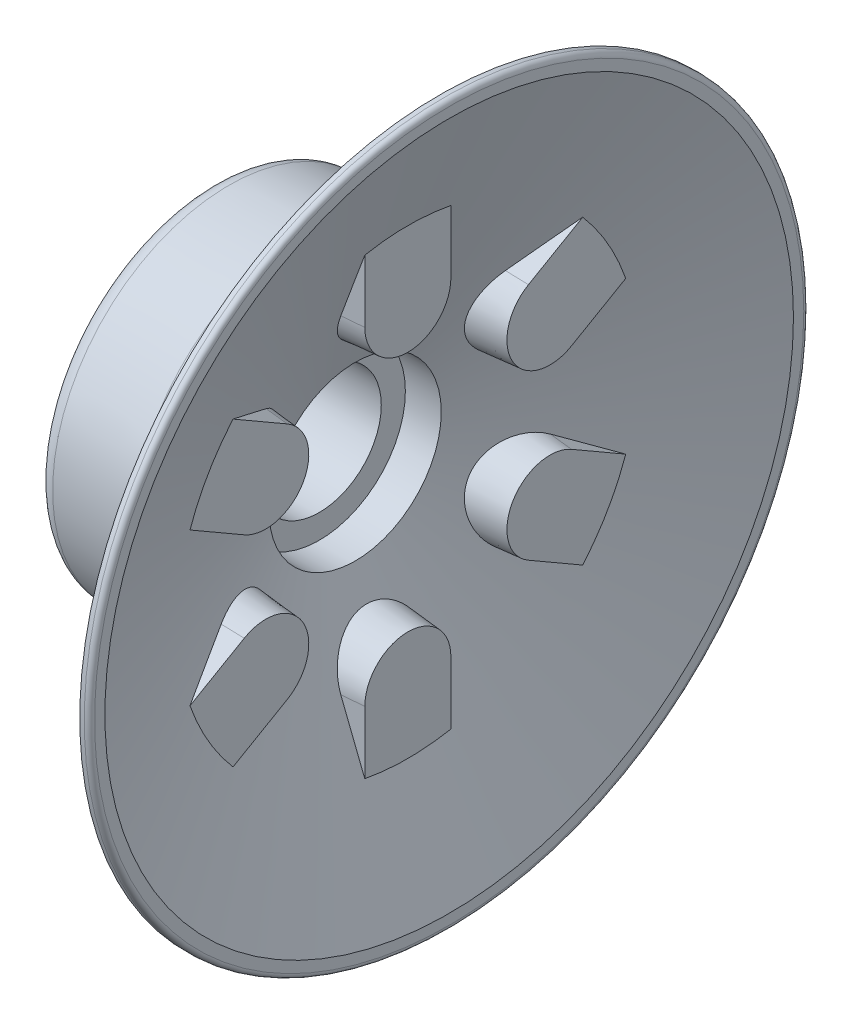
ISO-10303-21;
HEADER;
FILE_DESCRIPTION(('STEP AP214'),'2;1');
FILE_NAME('part.step','',(''),(''),'','','');
FILE_SCHEMA(('AUTOMOTIVE_DESIGN { 1 0 10303 214 1 1 1 1 }'));
ENDSEC;
DATA;
#1=APPLICATION_CONTEXT('core data for automotive mechanical design processes');
#2=APPLICATION_PROTOCOL_DEFINITION('international standard','automotive_design',2000,#1);
#3=PRODUCT_CONTEXT('',#1,'mechanical');
#4=PRODUCT('Part','Part','',(#3));
#5=PRODUCT_RELATED_PRODUCT_CATEGORY('part','',(#4));
#6=PRODUCT_DEFINITION_FORMATION('','',#4);
#7=PRODUCT_DEFINITION_CONTEXT('part definition',#1,'design');
#8=PRODUCT_DEFINITION('design','',#6,#7);
#9=PRODUCT_DEFINITION_SHAPE('','',#8);
#10=(LENGTH_UNIT() NAMED_UNIT(*) SI_UNIT(.MILLI.,.METRE.));
#11=(NAMED_UNIT(*) PLANE_ANGLE_UNIT() SI_UNIT($,.RADIAN.));
#12=(NAMED_UNIT(*) SI_UNIT($,.STERADIAN.) SOLID_ANGLE_UNIT());
#13=UNCERTAINTY_MEASURE_WITH_UNIT(LENGTH_MEASURE(1.E-05),#10,'distance_accuracy_value','');
#14=(GEOMETRIC_REPRESENTATION_CONTEXT(3) GLOBAL_UNCERTAINTY_ASSIGNED_CONTEXT((#13)) GLOBAL_UNIT_ASSIGNED_CONTEXT((#10,
#11,#12)) REPRESENTATION_CONTEXT('',''));
#15=CARTESIAN_POINT('',(0.,0.,0.));
#16=DIRECTION('',(0.,0.,1.));
#17=DIRECTION('',(1.,0.,0.));
#18=AXIS2_PLACEMENT_3D('',#15,#16,#17);
#19=CARTESIAN_POINT('',(-17.526,11.684,0.));
#20=DIRECTION('',(-1.,0.,0.));
#21=DIRECTION('',(0.,0.,1.));
#22=AXIS2_PLACEMENT_3D('',#19,#20,#21);
#23=PLANE('',#22);
#24=CARTESIAN_POINT('',(-17.526,0.,0.));
#25=DIRECTION('',(1.,0.,0.));
#26=DIRECTION('',(0.,0.,-1.));
#27=AXIS2_PLACEMENT_3D('',#24,#25,#26);
#28=CIRCLE('',#27,6.096);
#29=CARTESIAN_POINT('',(-17.526,0.,-6.096));
#30=VERTEX_POINT('',#29);
#31=EDGE_CURVE('E281',#30,#30,#28,.T.);
#32=ORIENTED_EDGE('',*,*,#31,.T.);
#33=EDGE_LOOP('',(#32));
#34=FACE_BOUND('',#33,.T.);
#35=CARTESIAN_POINT('',(-17.526,0.,0.));
#36=DIRECTION('',(1.,0.,0.));
#37=DIRECTION('',(0.,0.,-1.));
#38=AXIS2_PLACEMENT_3D('',#35,#36,#37);
#39=CIRCLE('',#38,11.684);
#40=CARTESIAN_POINT('',(-17.526,0.,-11.684));
#41=VERTEX_POINT('',#40);
#42=EDGE_CURVE('E10',#41,#41,#39,.T.);
#43=ORIENTED_EDGE('',*,*,#42,.F.);
#44=EDGE_LOOP('',(#43));
#45=FACE_BOUND('',#44,.T.);
#46=ADVANCED_FACE('F16',(#34,#45),#23,.T.);
#47=CARTESIAN_POINT('',(-16.2105602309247,0.,0.));
#48=DIRECTION('',(1.,0.,0.));
#49=DIRECTION('',(0.,0.,-1.));
#50=AXIS2_PLACEMENT_3D('',#47,#48,#49);
#51=TOROIDAL_SURFACE('',#50,11.684,1.31543976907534);
#52=ORIENTED_EDGE('',*,*,#42,.T.);
#53=EDGE_LOOP('',(#52));
#54=FACE_BOUND('',#53,.T.);
#55=CARTESIAN_POINT('',(-16.2564684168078,0.,0.));
#56=DIRECTION('',(1.,0.,0.));
#57=DIRECTION('',(0.,0.,-1.));
#58=AXIS2_PLACEMENT_3D('',#55,#56,#57);
#59=CIRCLE('',#58,12.99863843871);
#60=CARTESIAN_POINT('',(-16.2564684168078,0.,-12.99863843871));
#61=VERTEX_POINT('',#60);
#62=EDGE_CURVE('E24',#61,#61,#59,.T.);
#63=ORIENTED_EDGE('',*,*,#62,.F.);
#64=EDGE_LOOP('',(#63));
#65=FACE_BOUND('',#64,.T.);
#66=ADVANCED_FACE('F270',(#54,#65),#51,.T.);
#67=CARTESIAN_POINT('',(-10.26113772,0.,0.));
#68=DIRECTION('',(1.,0.,0.));
#69=DIRECTION('',(0.,0.,-1.));
#70=AXIS2_PLACEMENT_3D('',#67,#68,#69);
#71=CONICAL_SURFACE('',#70,13.208,0.0349065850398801);
#72=ORIENTED_EDGE('',*,*,#62,.T.);
#73=EDGE_LOOP('',(#72));
#74=FACE_BOUND('',#73,.T.);
#75=CARTESIAN_POINT('',(-10.26113772,0.,0.));
#76=DIRECTION('',(1.,0.,0.));
#77=DIRECTION('',(0.,0.,-1.));
#78=AXIS2_PLACEMENT_3D('',#75,#76,#77);
#79=CIRCLE('',#78,13.208);
#80=CARTESIAN_POINT('',(-10.26113772,0.,-13.208));
#81=VERTEX_POINT('',#80);
#82=EDGE_CURVE('E288',#81,#81,#79,.T.);
#83=ORIENTED_EDGE('',*,*,#82,.F.);
#84=EDGE_LOOP('',(#83));
#85=FACE_BOUND('',#84,.T.);
#86=ADVANCED_FACE('F276',(#74,#85),#71,.T.);
#87=CARTESIAN_POINT('',(-10.261137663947,0.,0.));
#88=DIRECTION('',(1.,0.,0.));
#89=DIRECTION('',(0.,0.,-1.));
#90=AXIS2_PLACEMENT_3D('',#87,#88,#89);
#91=TOROIDAL_SURFACE('',#90,16.383,3.175);
#92=ORIENTED_EDGE('',*,*,#82,.T.);
#93=EDGE_LOOP('',(#92));
#94=FACE_BOUND('',#93,.T.);
#95=CARTESIAN_POINT('',(-7.51332,0.,0.));
#96=DIRECTION('',(1.,0.,0.));
#97=DIRECTION('',(0.,0.,-1.));
#98=AXIS2_PLACEMENT_3D('',#95,#96,#97);
#99=CIRCLE('',#98,14.7923639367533);
#100=CARTESIAN_POINT('',(-7.51332,0.,-14.7923639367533));
#101=VERTEX_POINT('',#100);
#102=EDGE_CURVE('E295',#101,#101,#99,.T.);
#103=ORIENTED_EDGE('',*,*,#102,.F.);
#104=EDGE_LOOP('',(#103));
#105=FACE_BOUND('',#104,.T.);
#106=ADVANCED_FACE('F401',(#94,#105),#91,.F.);
#107=CARTESIAN_POINT('',(-0.7112,0.,0.));
#108=DIRECTION('',(1.,0.,0.));
#109=DIRECTION('',(0.,0.,-1.));
#110=AXIS2_PLACEMENT_3D('',#107,#108,#109);
#111=CONICAL_SURFACE('',#110,26.543,1.04605663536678);
#112=ORIENTED_EDGE('',*,*,#102,.T.);
#113=EDGE_LOOP('',(#112));
#114=FACE_BOUND('',#113,.T.);
#115=CARTESIAN_POINT('',(-0.7112,0.,0.));
#116=DIRECTION('',(1.,0.,0.));
#117=DIRECTION('',(0.,0.,-1.));
#118=AXIS2_PLACEMENT_3D('',#115,#116,#117);
#119=CIRCLE('',#118,26.543);
#120=CARTESIAN_POINT('',(-0.7112,0.,-26.543));
#121=VERTEX_POINT('',#120);
#122=EDGE_CURVE('E301',#121,#121,#119,.T.);
#123=ORIENTED_EDGE('',*,*,#122,.F.);
#124=EDGE_LOOP('',(#123));
#125=FACE_BOUND('',#124,.T.);
#126=ADVANCED_FACE('F397',(#114,#125),#111,.T.);
#127=CARTESIAN_POINT('',(0.,0.,0.));
#128=DIRECTION('',(1.,0.,0.));
#129=DIRECTION('',(0.,0.,-1.));
#130=AXIS2_PLACEMENT_3D('',#127,#128,#129);
#131=CYLINDRICAL_SURFACE('',#130,26.543);
#132=ORIENTED_EDGE('',*,*,#122,.T.);
#133=EDGE_LOOP('',(#132));
#134=FACE_BOUND('',#133,.T.);
#135=CARTESIAN_POINT('',(-0.381000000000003,0.,0.));
#136=DIRECTION('',(1.,0.,0.));
#137=DIRECTION('',(0.,0.,-1.));
#138=AXIS2_PLACEMENT_3D('',#135,#136,#137);
#139=CIRCLE('',#138,26.543);
#140=CARTESIAN_POINT('',(-0.381000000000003,0.,-26.543));
#141=VERTEX_POINT('',#140);
#142=EDGE_CURVE('E305',#141,#141,#139,.T.);
#143=ORIENTED_EDGE('',*,*,#142,.F.);
#144=EDGE_LOOP('',(#143));
#145=FACE_BOUND('',#144,.T.);
#146=ADVANCED_FACE('F393',(#134,#145),#131,.T.);
#147=CARTESIAN_POINT('',(-0.381,0.,0.));
#148=DIRECTION('',(1.,0.,0.));
#149=DIRECTION('',(0.,0.,-1.));
#150=AXIS2_PLACEMENT_3D('',#147,#148,#149);
#151=TOROIDAL_SURFACE('',#150,26.162,0.381);
#152=ORIENTED_EDGE('',*,*,#142,.T.);
#153=EDGE_LOOP('',(#152));
#154=FACE_BOUND('',#153,.T.);
#155=CARTESIAN_POINT('',(0.,0.,0.));
#156=DIRECTION('',(1.,0.,0.));
#157=DIRECTION('',(0.,0.,-1.));
#158=AXIS2_PLACEMENT_3D('',#155,#156,#157);
#159=CIRCLE('',#158,26.162);
#160=CARTESIAN_POINT('',(0.,0.,-26.162));
#161=VERTEX_POINT('',#160);
#162=EDGE_CURVE('E309',#161,#161,#159,.T.);
#163=ORIENTED_EDGE('',*,*,#162,.F.);
#164=EDGE_LOOP('',(#163));
#165=FACE_BOUND('',#164,.T.);
#166=ADVANCED_FACE('F389',(#154,#165),#151,.T.);
#167=CARTESIAN_POINT('',(0.,0.,0.));
#168=DIRECTION('',(1.,0.,0.));
#169=DIRECTION('',(0.,0.,-1.));
#170=AXIS2_PLACEMENT_3D('',#167,#168,#169);
#171=PLANE('',#170);
#172=CARTESIAN_POINT('',(0.,0.,0.));
#173=DIRECTION('',(1.,0.,0.));
#174=DIRECTION('',(0.,0.,-1.));
#175=AXIS2_PLACEMENT_3D('',#172,#173,#174);
#176=CIRCLE('',#175,25.4);
#177=CARTESIAN_POINT('',(0.,0.,-25.4));
#178=VERTEX_POINT('',#177);
#179=EDGE_CURVE('E313',#178,#178,#176,.T.);
#180=ORIENTED_EDGE('',*,*,#179,.F.);
#181=EDGE_LOOP('',(#180));
#182=FACE_BOUND('',#181,.T.);
#183=ORIENTED_EDGE('',*,*,#162,.T.);
#184=EDGE_LOOP('',(#183));
#185=FACE_BOUND('',#184,.T.);
#186=ADVANCED_FACE('F385',(#182,#185),#171,.T.);
#187=CARTESIAN_POINT('',(0.,0.,0.));
#188=DIRECTION('',(1.,0.,0.));
#189=DIRECTION('',(0.,0.,-1.));
#190=AXIS2_PLACEMENT_3D('',#187,#188,#189);
#191=CONICAL_SURFACE('',#190,25.4,1.22173047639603);
#192=CARTESIAN_POINT('',(-6.93363296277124,0.,0.));
#193=DIRECTION('',(1.,0.,0.));
#194=DIRECTION('',(0.,0.,-1.));
#195=AXIS2_PLACEMENT_3D('',#192,#193,#194);
#196=CIRCLE('',#195,6.35);
#197=CARTESIAN_POINT('',(-6.93363296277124,0.,-6.35));
#198=VERTEX_POINT('',#197);
#199=EDGE_CURVE('E769',#198,#198,#196,.T.);
#200=ORIENTED_EDGE('',*,*,#199,.F.);
#201=EDGE_LOOP('',(#200));
#202=FACE_BOUND('',#201,.T.);
#203=CARTESIAN_POINT('',(-3.0478,5.61417964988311,16.074009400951));
#204=CARTESIAN_POINT('',(-3.18705669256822,5.40774719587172,15.7408246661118));
#205=CARTESIAN_POINT('',(-3.32611824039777,5.20129450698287,15.407570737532));
#206=CARTESIAN_POINT('',(-3.60373439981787,4.78833770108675,14.7408851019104));
#207=CARTESIAN_POINT('',(-3.74228901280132,4.58183358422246,14.4074533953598));
#208=CARTESIAN_POINT('',(-4.01877558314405,4.16876158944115,13.7403705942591));
#209=CARTESIAN_POINT('',(-4.15670753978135,3.96219371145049,13.406719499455));
#210=CARTESIAN_POINT('',(-4.43176355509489,3.548975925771,12.7391338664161));
#211=CARTESIAN_POINT('',(-4.56888761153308,3.34232601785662,12.4051993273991));
#212=CARTESIAN_POINT('',(-4.70551479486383,3.13562641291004,12.071091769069));
#213=B_SPLINE_CURVE_WITH_KNOTS('',3,(#203,#204,#205,#206,#207,#208,#209,#210,#211,#212),
.UNSPECIFIED.,.F.,.F.,(4,2,2,2,4),(0.,1.24786618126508,2.49572893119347,3.74359312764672,
4.99146077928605),.UNSPECIFIED.);
#214=CARTESIAN_POINT('',(-3.048,5.6138831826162,16.0735309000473));
#215=VERTEX_POINT('',#214);
#216=CARTESIAN_POINT('',(-4.67629911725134,3.17981734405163,12.1425206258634));
#217=VERTEX_POINT('',#216);
#218=EDGE_CURVE('E194',#215,#217,#213,.T.);
#219=ORIENTED_EDGE('',*,*,#218,.F.);
#220=CARTESIAN_POINT('',(-3.048,0.,0.));
#221=DIRECTION('',(1.,0.,0.));
#222=DIRECTION('',(0.,0.,-1.));
#223=AXIS2_PLACEMENT_3D('',#220,#221,#222);
#224=CIRCLE('',#223,17.0256888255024);
#225=CARTESIAN_POINT('',(-3.048,11.1131444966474,12.8985309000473));
#226=VERTEX_POINT('',#225);
#227=EDGE_CURVE('E200',#226,#215,#224,.T.);
#228=ORIENTED_EDGE('',*,*,#227,.F.);
#229=CARTESIAN_POINT('',(-4.76702934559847,8.8022506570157,8.59515419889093));
#230=CARTESIAN_POINT('',(-4.62543615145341,8.9952708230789,8.954250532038));
#231=CARTESIAN_POINT('',(-4.48328796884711,9.18815147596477,9.31320233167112));
#232=CARTESIAN_POINT('',(-4.19809630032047,9.57368629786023,10.0308703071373));
#233=CARTESIAN_POINT('',(-4.0550528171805,9.76634046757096,10.3895864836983));
#234=CARTESIAN_POINT('',(-3.76828453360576,10.1514758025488,11.1068383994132));
#235=CARTESIAN_POINT('',(-3.62455973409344,10.3439569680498,11.4653741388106));
#236=CARTESIAN_POINT('',(-3.33655970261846,10.7287801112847,12.1823008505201));
#237=CARTESIAN_POINT('',(-3.19228446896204,10.9211220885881,12.5406918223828));
#238=CARTESIAN_POINT('',(-3.0478,11.1134106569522,12.8990268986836));
#239=B_SPLINE_CURVE_WITH_KNOTS('',3,(#229,#230,#231,#232,#233,#234,#235,#236,#237,#238),
.UNSPECIFIED.,.F.,.F.,(4,2,2,2,4),(0.,1.29471895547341,2.58943389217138,3.88414707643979,
5.17886424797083),.UNSPECIFIED.);
#240=CARTESIAN_POINT('',(-4.67629911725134,8.92582265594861,8.82506291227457));
#241=VERTEX_POINT('',#240);
#242=EDGE_CURVE('E184',#241,#226,#239,.T.);
#243=ORIENTED_EDGE('',*,*,#242,.F.);
#244=CARTESIAN_POINT('',(-4.43691715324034,3.61687308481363,12.704865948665));
#245=CARTESIAN_POINT('',(-4.46902679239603,3.54744372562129,12.632901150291));
#246=CARTESIAN_POINT('',(-4.50175157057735,3.48140298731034,12.5579615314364));
#247=CARTESIAN_POINT('',(-4.56823660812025,3.35648283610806,12.4027888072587));
#248=CARTESIAN_POINT('',(-4.60199664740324,3.29760191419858,12.3225568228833));
#249=CARTESIAN_POINT('',(-4.67032948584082,3.18742299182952,12.1575251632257));
#250=CARTESIAN_POINT('',(-4.70490124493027,3.13611584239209,12.0727311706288));
#251=CARTESIAN_POINT('',(-4.77468568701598,3.04130770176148,11.899166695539));
#252=CARTESIAN_POINT('',(-4.80989839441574,2.99780700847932,11.8103960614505));
#253=CARTESIAN_POINT('',(-4.91616779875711,2.87945825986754,11.539146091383));
#254=CARTESIAN_POINT('',(-4.98793946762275,2.81662877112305,11.3515258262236));
#255=CARTESIAN_POINT('',(-5.13139030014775,2.72483605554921,10.9682231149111));
#256=CARTESIAN_POINT('',(-5.20306944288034,2.69587947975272,10.7725390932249));
#257=CARTESIAN_POINT('',(-5.34539305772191,2.67262319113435,10.3750146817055));
#258=CARTESIAN_POINT('',(-5.41600101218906,2.67890247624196,10.1731259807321));
#259=CARTESIAN_POINT('',(-5.55220806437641,2.72804568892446,9.77207368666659));
#260=CARTESIAN_POINT('',(-5.61780651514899,2.77091433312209,9.57291044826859));
#261=CARTESIAN_POINT('',(-5.7390091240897,2.89168038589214,9.1885750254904));
#262=CARTESIAN_POINT('',(-5.79483786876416,2.96858587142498,9.00316901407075));
#263=CARTESIAN_POINT('',(-5.86987967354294,3.10914876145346,8.73615320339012));
#264=CARTESIAN_POINT('',(-5.89345007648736,3.16022600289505,8.64896839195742));
#265=CARTESIAN_POINT('',(-5.93722670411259,3.27056276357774,8.47906835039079));
#266=CARTESIAN_POINT('',(-5.95743488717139,3.32981748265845,8.39635053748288));
#267=CARTESIAN_POINT('',(-5.99243948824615,3.45069997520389,8.2431598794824));
#268=CARTESIAN_POINT('',(-6.00755277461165,3.51167942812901,8.17224670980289));
#269=CARTESIAN_POINT('',(-6.03425177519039,3.63978073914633,8.03554485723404));
#270=CARTESIAN_POINT('',(-6.04583936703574,3.70689930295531,7.96975346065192));
#271=CARTESIAN_POINT('',(-6.06521316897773,3.84679995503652,7.84393499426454));
#272=CARTESIAN_POINT('',(-6.07300121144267,3.91957929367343,7.78390515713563));
#273=CARTESIAN_POINT('',(-6.08459012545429,4.07019977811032,7.67019496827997));
#274=CARTESIAN_POINT('',(-6.08839133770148,4.1480404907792,7.6165140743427));
#275=CARTESIAN_POINT('',(-6.09328030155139,4.37217668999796,7.47585236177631));
#276=CARTESIAN_POINT('',(-6.08977750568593,4.52350070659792,7.39650973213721));
#277=CARTESIAN_POINT('',(-6.06974396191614,4.83575471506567,7.26246809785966));
#278=CARTESIAN_POINT('',(-6.05321394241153,4.99668416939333,7.20776771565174));
#279=CARTESIAN_POINT('',(-6.00892099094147,5.32029841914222,7.1247065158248));
#280=CARTESIAN_POINT('',(-5.98138035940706,5.48288982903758,7.09585905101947));
#281=CARTESIAN_POINT('',(-5.91692029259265,5.8086723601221,7.06258045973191));
#282=CARTESIAN_POINT('',(-5.87999851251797,5.97186362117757,7.05815544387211));
#283=CARTESIAN_POINT('',(-5.79575570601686,6.30731971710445,7.07345482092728));
#284=CARTESIAN_POINT('',(-5.74786555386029,6.47935693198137,7.09499939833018));
#285=CARTESIAN_POINT('',(-5.64591396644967,6.81629394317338,7.16381397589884));
#286=CARTESIAN_POINT('',(-5.59185005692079,6.98119084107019,7.21109431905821));
#287=CARTESIAN_POINT('',(-5.47402819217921,7.31648498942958,7.33551731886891));
#288=CARTESIAN_POINT('',(-5.40984052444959,7.48580747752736,7.41515532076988));
#289=CARTESIAN_POINT('',(-5.27877226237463,7.80815596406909,7.60083869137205));
#290=CARTESIAN_POINT('',(-5.21189072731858,7.96117620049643,7.70689335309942));
#291=CARTESIAN_POINT('',(-5.07296418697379,8.25674796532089,7.95029199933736));
#292=CARTESIAN_POINT('',(-5.00086609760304,8.39797280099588,8.08922154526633));
#293=CARTESIAN_POINT('',(-4.85774826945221,8.65405408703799,8.39006791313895));
#294=CARTESIAN_POINT('',(-4.78672866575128,8.76890725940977,8.55198758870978));
#295=CARTESIAN_POINT('',(-4.6465573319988,8.96998761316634,8.8967504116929));
#296=CARTESIAN_POINT('',(-4.5774427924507,9.05581556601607,9.07984224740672));
#297=CARTESIAN_POINT('',(-4.44370251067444,9.1934417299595,9.45996316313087));
#298=CARTESIAN_POINT('',(-4.37907638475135,9.24524285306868,9.65699104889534));
#299=CARTESIAN_POINT('',(-4.2574887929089,9.31133449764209,10.0535406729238));
#300=CARTESIAN_POINT('',(-4.20036661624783,9.32660735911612,10.2528486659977));
#301=CARTESIAN_POINT('',(-4.09307408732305,9.32099125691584,10.6528673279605));
#302=CARTESIAN_POINT('',(-4.04290246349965,9.30010891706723,10.8535777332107));
#303=CARTESIAN_POINT('',(-3.95286310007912,9.22365301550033,11.240399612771));
#304=CARTESIAN_POINT('',(-3.91262323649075,9.16974736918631,11.4267548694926));
#305=CARTESIAN_POINT('',(-3.84048175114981,9.02955431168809,11.7884997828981));
#306=CARTESIAN_POINT('',(-3.80857097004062,8.94330272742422,11.9639013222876));
#307=CARTESIAN_POINT('',(-3.76431151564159,8.77944791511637,12.233814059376));
#308=CARTESIAN_POINT('',(-3.74914770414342,8.71113951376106,12.333618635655));
#309=CARTESIAN_POINT('',(-3.72242310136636,8.56385177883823,12.5253908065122));
#310=CARTESIAN_POINT('',(-3.71085905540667,8.48488217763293,12.6173654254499));
#311=CARTESIAN_POINT('',(-3.70114491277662,8.40092059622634,12.704865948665));
#312=B_SPLINE_CURVE_WITH_KNOTS('',3,(#244,#245,#246,#247,#248,#249,#250,#251,#252,#253,#254,
#255,#256,#257,#258,#259,#260,#261,#262,#263,#264,#265,#266,#267,#268,#269,#270,#271,#272,#273,
#274,#275,#276,#277,#278,#279,#280,#281,#282,#283,#284,#285,#286,#287,#288,#289,#290,#291,#292,
#293,#294,#295,#296,#297,#298,#299,#300,#301,#302,#303,#304,#305,#306,#307,#308,#309,#310,#311),
.UNSPECIFIED.,.F.,.F.,(4,2,2,2,2,2,2,2,2,2,2,2,2,2,2,2,2,2,2,2,2,2,2,2,2,2,2,2,2,2,2,2,2,4),(0.,
0.314957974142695,0.629849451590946,0.944357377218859,1.25887730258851,1.88715410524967,
2.5155542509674,3.15431022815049,3.79314855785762,4.41448355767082,4.72536752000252,
5.03606976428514,5.31990382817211,5.60358646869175,5.88713216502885,6.17065362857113,
6.68057303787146,7.19046393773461,7.69054195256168,8.19074508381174,8.72814264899,
9.26575634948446,9.8566559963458,10.4477638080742,11.0772881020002,11.7068906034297,
12.3448307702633,12.9827163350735,13.6032444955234,14.2236589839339,14.8150612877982,
15.4058104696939,15.7707663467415,16.135391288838),.UNSPECIFIED.);
#313=EDGE_CURVE('E1046',#217,#241,#312,.T.);
#314=ORIENTED_EDGE('',*,*,#313,.F.);
#315=EDGE_LOOP('',(#219,#228,#243,#314));
#316=FACE_BOUND('',#315,.T.);
#317=CARTESIAN_POINT('',(-3.0478,-11.1134106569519,12.8990268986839));
#318=CARTESIAN_POINT('',(-3.19228446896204,-10.9211220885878,12.540691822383));
#319=CARTESIAN_POINT('',(-3.33655970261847,-10.7287801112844,12.1823008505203));
#320=CARTESIAN_POINT('',(-3.62455973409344,-10.3439569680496,11.4653741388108));
#321=CARTESIAN_POINT('',(-3.76828453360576,-10.1514758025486,11.1068383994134));
#322=CARTESIAN_POINT('',(-4.0550528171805,-9.76634046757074,10.3895864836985));
#323=CARTESIAN_POINT('',(-4.19809630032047,-9.57368629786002,10.0308703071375));
#324=CARTESIAN_POINT('',(-4.48328796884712,-9.18815147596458,9.31320233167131));
#325=CARTESIAN_POINT('',(-4.62543615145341,-8.9952708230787,8.95425053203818));
#326=CARTESIAN_POINT('',(-4.76702934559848,-8.80225065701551,8.59515419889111));
#327=B_SPLINE_CURVE_WITH_KNOTS('',3,(#317,#318,#319,#320,#321,#322,#323,#324,#325,#326),
.UNSPECIFIED.,.F.,.F.,(4,2,2,2,4),(0.,1.29471717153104,2.58943035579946,3.88414529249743,
5.17886424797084),.UNSPECIFIED.);
#328=CARTESIAN_POINT('',(-3.048,-11.1131444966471,12.8985309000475));
#329=VERTEX_POINT('',#328);
#330=CARTESIAN_POINT('',(-4.67629911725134,-8.92582265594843,8.82506291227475));
#331=VERTEX_POINT('',#330);
#332=EDGE_CURVE('E218',#329,#331,#327,.T.);
#333=ORIENTED_EDGE('',*,*,#332,.F.);
#334=CARTESIAN_POINT('',(-3.048,0.,0.));
#335=DIRECTION('',(1.,0.,0.));
#336=DIRECTION('',(0.,0.,-1.));
#337=AXIS2_PLACEMENT_3D('',#334,#335,#336);
#338=CIRCLE('',#337,17.0256888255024);
#339=CARTESIAN_POINT('',(-3.048,-5.61388318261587,16.0735309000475));
#340=VERTEX_POINT('',#339);
#341=EDGE_CURVE('E984',#340,#329,#338,.T.);
#342=ORIENTED_EDGE('',*,*,#341,.F.);
#343=CARTESIAN_POINT('',(-4.70551479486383,-3.13562641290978,12.0710917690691));
#344=CARTESIAN_POINT('',(-4.56888761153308,-3.34232601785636,12.4051993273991));
#345=CARTESIAN_POINT('',(-4.43176355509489,-3.54897592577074,12.7391338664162));
#346=CARTESIAN_POINT('',(-4.15670753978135,-3.96219371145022,13.4067194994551));
#347=CARTESIAN_POINT('',(-4.01877558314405,-4.16876158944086,13.7403705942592));
#348=CARTESIAN_POINT('',(-3.74228901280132,-4.58183358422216,14.4074533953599));
#349=CARTESIAN_POINT('',(-3.60373439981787,-4.78833770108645,14.7408851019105));
#350=CARTESIAN_POINT('',(-3.32611824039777,-5.20129450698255,15.4075707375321));
#351=CARTESIAN_POINT('',(-3.18705669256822,-5.40774719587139,15.7408246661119));
#352=CARTESIAN_POINT('',(-3.0478,-5.61417964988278,16.0740094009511));
#353=B_SPLINE_CURVE_WITH_KNOTS('',3,(#343,#344,#345,#346,#347,#348,#349,#350,#351,#352),
.UNSPECIFIED.,.F.,.F.,(4,2,2,2,4),(0.,1.24786765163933,2.49573184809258,3.74359459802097,
4.99146077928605),.UNSPECIFIED.);
#354=CARTESIAN_POINT('',(-4.67629911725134,-3.17981734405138,12.1425206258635));
#355=VERTEX_POINT('',#354);
#356=EDGE_CURVE('E210',#355,#340,#353,.T.);
#357=ORIENTED_EDGE('',*,*,#356,.F.);
#358=CARTESIAN_POINT('',(-3.70114491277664,-8.4009205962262,12.704865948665));
#359=CARTESIAN_POINT('',(-3.70850816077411,-8.46456479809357,12.6385352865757));
#360=CARTESIAN_POINT('',(-3.71693849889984,-8.52536577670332,12.5696080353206));
#361=CARTESIAN_POINT('',(-3.7358764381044,-8.64090697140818,12.427138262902));
#362=CARTESIAN_POINT('',(-3.74638360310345,-8.69564845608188,12.3535967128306));
#363=CARTESIAN_POINT('',(-3.76939572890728,-8.79860843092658,12.202616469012));
#364=CARTESIAN_POINT('',(-3.78189618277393,-8.84684119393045,12.1251868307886));
#365=CARTESIAN_POINT('',(-3.8088373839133,-8.93663974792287,11.9669016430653));
#366=CARTESIAN_POINT('',(-3.82327818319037,-8.97820536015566,11.886046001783));
#367=CARTESIAN_POINT('',(-3.86939488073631,-9.09250902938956,11.6392894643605));
#368=CARTESIAN_POINT('',(-3.90389303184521,-9.1549787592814,11.4690148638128));
#369=CARTESIAN_POINT('',(-3.97965859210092,-9.25124261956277,11.1220808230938));
#370=CARTESIAN_POINT('',(-4.02092791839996,-9.2850286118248,10.9454195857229));
#371=CARTESIAN_POINT('',(-4.11080737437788,-9.32440596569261,10.5850340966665));
#372=CARTESIAN_POINT('',(-4.15960271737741,-9.32910778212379,10.4012585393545));
#373=CARTESIAN_POINT('',(-4.26260800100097,-9.3086317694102,10.0369277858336));
#374=CARTESIAN_POINT('',(-4.31681936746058,-9.2834460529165,9.85637345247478));
#375=CARTESIAN_POINT('',(-4.43230036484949,-9.2027377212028,9.4947298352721));
#376=CARTESIAN_POINT('',(-4.49378192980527,-9.14584564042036,9.31401382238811));
#377=CARTESIAN_POINT('',(-4.62033537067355,-9.00309234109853,8.96577865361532));
#378=CARTESIAN_POINT('',(-4.6854079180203,-8.9172256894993,8.79826198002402));
#379=CARTESIAN_POINT('',(-4.82078181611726,-8.71479918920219,8.47341352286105));
#380=CARTESIAN_POINT('',(-4.89118684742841,-8.59703790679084,8.31687282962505));
#381=CARTESIAN_POINT('',(-5.03278784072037,-8.336344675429,8.02676777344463));
#382=CARTESIAN_POINT('',(-5.10398397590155,-8.19340710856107,7.89320855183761));
#383=CARTESIAN_POINT('',(-5.24708619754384,-7.88212355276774,7.64953281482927));
#384=CARTESIAN_POINT('',(-5.31896222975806,-7.71321127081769,7.54011998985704));
#385=CARTESIAN_POINT('',(-5.45902867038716,-7.35732230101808,7.35277146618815));
#386=CARTESIAN_POINT('',(-5.52721859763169,-7.17034326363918,7.27483986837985));
#387=CARTESIAN_POINT('',(-5.65597102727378,-6.78589292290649,7.15452520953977));
#388=CARTESIAN_POINT('',(-5.71663063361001,-6.58861545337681,7.11163810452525));
#389=CARTESIAN_POINT('',(-5.80003202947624,-6.287463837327,7.07458206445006));
#390=CARTESIAN_POINT('',(-5.82657815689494,-6.18616019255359,7.06677848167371));
#391=CARTESIAN_POINT('',(-5.8766691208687,-5.98254579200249,7.06052520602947));
#392=CARTESIAN_POINT('',(-5.90021564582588,-5.88023563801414,7.0620702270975));
#393=CARTESIAN_POINT('',(-5.94220757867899,-5.68302659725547,7.07425992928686));
#394=CARTESIAN_POINT('',(-5.96090119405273,-5.58813793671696,7.0842246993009));
#395=CARTESIAN_POINT('',(-5.99490275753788,-5.39903346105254,7.11244912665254));
#396=CARTESIAN_POINT('',(-6.01021251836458,-5.30481731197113,7.13070432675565));
#397=CARTESIAN_POINT('',(-6.03709529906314,-5.11788057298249,7.17551004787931));
#398=CARTESIAN_POINT('',(-6.04867048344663,-5.02515914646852,7.20205574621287));
#399=CARTESIAN_POINT('',(-6.06780679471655,-4.84206312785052,7.26331183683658));
#400=CARTESIAN_POINT('',(-6.07536834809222,-4.75168828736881,7.2980213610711));
#401=CARTESIAN_POINT('',(-6.09054566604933,-4.50409069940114,7.40594750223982));
#402=CARTESIAN_POINT('',(-6.09351319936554,-4.3502817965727,7.48796097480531));
#403=CARTESIAN_POINT('',(-6.08558559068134,-4.05791530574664,7.67500174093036));
#404=CARTESIAN_POINT('',(-6.07469324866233,-3.9193546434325,7.78002438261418));
#405=CARTESIAN_POINT('',(-6.04079585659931,-3.66695637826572,8.00452350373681));
#406=CARTESIAN_POINT('',(-6.01833822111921,-3.55230561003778,8.12317269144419));
#407=CARTESIAN_POINT('',(-5.96326176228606,-3.34285649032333,8.37472498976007));
#408=CARTESIAN_POINT('',(-5.93064096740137,-3.24806199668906,8.50763086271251));
#409=CARTESIAN_POINT('',(-5.85505738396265,-3.0749000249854,8.79213731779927));
#410=CARTESIAN_POINT('',(-5.81160688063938,-2.99779426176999,8.94437389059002));
#411=CARTESIAN_POINT('',(-5.71779345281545,-2.86818372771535,9.25695407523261));
#412=CARTESIAN_POINT('',(-5.66742776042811,-2.81568884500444,9.41730091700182));
#413=CARTESIAN_POINT('',(-5.55655996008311,-2.73156477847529,9.75881340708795));
#414=CARTESIAN_POINT('',(-5.4955478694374,-2.70254617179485,9.9404578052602));
#415=CARTESIAN_POINT('',(-5.36999031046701,-2.67446939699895,10.304838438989));
#416=CARTESIAN_POINT('',(-5.30544353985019,-2.67542234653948,10.4875750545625));
#417=CARTESIAN_POINT('',(-5.16978962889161,-2.70801382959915,10.8637357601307));
#418=CARTESIAN_POINT('',(-5.09855678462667,-2.74197954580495,11.0569162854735));
#419=CARTESIAN_POINT('',(-4.95632465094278,-2.84298570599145,11.4344786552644));
#420=CARTESIAN_POINT('',(-4.88532535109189,-2.91002465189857,11.6188608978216));
#421=CARTESIAN_POINT('',(-4.74964952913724,-3.07045032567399,11.9627325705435));
#422=CARTESIAN_POINT('',(-4.68485460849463,-3.16193619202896,12.1230571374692));
#423=CARTESIAN_POINT('',(-4.58997675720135,-3.31842129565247,12.3511609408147));
#424=CARTESIAN_POINT('',(-4.55871865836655,-3.37383108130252,12.4251720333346));
#425=CARTESIAN_POINT('',(-4.49710660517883,-3.49080521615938,12.5685902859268));
#426=CARTESIAN_POINT('',(-4.46675284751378,-3.5523708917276,12.6379964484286));
#427=CARTESIAN_POINT('',(-4.43691715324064,-3.6168730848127,12.7048659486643));
#428=B_SPLINE_CURVE_WITH_KNOTS('',3,(#358,#359,#360,#361,#362,#363,#364,#365,#366,#367,#368,
#369,#370,#371,#372,#373,#374,#375,#376,#377,#378,#379,#380,#381,#382,#383,#384,#385,#386,#387,
#388,#389,#390,#391,#392,#393,#394,#395,#396,#397,#398,#399,#400,#401,#402,#403,#404,#405,#406,
#407,#408,#409,#410,#411,#412,#413,#414,#415,#416,#417,#418,#419,#420,#421,#422,#423,#424,#425,
#426,#427),.UNSPECIFIED.,.F.,.F.,(4,2,2,2,2,2,2,2,2,2,2,2,2,2,2,2,2,2,2,2,2,2,2,2,2,2,2,2,2,2,2,
2,2,2,4),(0.,0.276559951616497,0.553061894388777,0.828947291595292,1.10484008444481,
1.65596150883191,2.2072392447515,2.77529777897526,3.3435062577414,3.93840563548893,
4.5334166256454,5.15505090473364,5.77682407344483,6.41484297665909,7.05294496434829,
7.68169906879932,7.99636209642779,8.31084721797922,8.6021253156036,8.89324699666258,
9.18419964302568,9.47512136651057,9.99518266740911,10.5151389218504,11.0124810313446,
11.5099196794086,12.0360292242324,12.5623499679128,13.1412869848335,13.720438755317,
14.3436171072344,14.966767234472,15.5511095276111,15.8436288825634,16.1362114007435),.UNSPECIFIED.);
#429=EDGE_CURVE('E248',#331,#355,#428,.T.);
#430=ORIENTED_EDGE('',*,*,#429,.F.);
#431=EDGE_LOOP('',(#333,#342,#357,#430));
#432=FACE_BOUND('',#431,.T.);
#433=CARTESIAN_POINT('',(-3.0478,-16.727590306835,-3.17498250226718));
#434=CARTESIAN_POINT('',(-3.18458180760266,-16.3427908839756,-3.186949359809));
#435=CARTESIAN_POINT('',(-3.32117500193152,-15.957923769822,-3.19889971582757));
#436=CARTESIAN_POINT('',(-3.59387429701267,-15.188016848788,-3.22275781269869));
#437=CARTESIAN_POINT('',(-3.72998039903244,-14.8029770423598,-3.23466555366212));
#438=CARTESIAN_POINT('',(-4.00159650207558,-14.0326850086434,-3.25842888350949));
#439=CARTESIAN_POINT('',(-4.13710650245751,-13.6474327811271,-3.27028447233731));
#440=CARTESIAN_POINT('',(-4.40735762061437,-12.87665560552,-3.29392838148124));
#441=CARTESIAN_POINT('',(-4.5420987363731,-12.4911306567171,-3.30571670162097));
#442=CARTESIAN_POINT('',(-4.67636873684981,-12.10544,-3.3174638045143));
#443=B_SPLINE_CURVE_WITH_KNOTS('',3,(#433,#434,#435,#436,#437,#438,#439,#440,#441,#442),
.UNSPECIFIED.,.F.,.F.,(4,2,2,2,4),(0.,1.22568669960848,2.45137020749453,3.67705503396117,
4.90274307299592),.UNSPECIFIED.);
#444=CARTESIAN_POINT('',(-3.048,-16.7270276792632,-3.17499999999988));
#445=VERTEX_POINT('',#444);
#446=CARTESIAN_POINT('',(-4.67629911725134,-12.10564,-3.31745771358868));
#447=VERTEX_POINT('',#446);
#448=EDGE_CURVE('E973',#445,#447,#443,.T.);
#449=ORIENTED_EDGE('',*,*,#448,.F.);
#450=CARTESIAN_POINT('',(-3.048,0.,0.));
#451=DIRECTION('',(1.,0.,0.));
#452=DIRECTION('',(0.,0.,-1.));
#453=AXIS2_PLACEMENT_3D('',#450,#451,#452);
#454=CIRCLE('',#453,17.0256888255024);
#455=CARTESIAN_POINT('',(-3.048,-16.7270276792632,3.17500000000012));
#456=VERTEX_POINT('',#455);
#457=EDGE_CURVE('E931',#456,#445,#454,.T.);
#458=ORIENTED_EDGE('',*,*,#457,.F.);
#459=CARTESIAN_POINT('',(-4.67636873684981,-12.10544,3.31746380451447));
#460=CARTESIAN_POINT('',(-4.5420987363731,-12.4911306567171,3.30571670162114));
#461=CARTESIAN_POINT('',(-4.40735762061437,-12.87665560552,3.29392838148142));
#462=CARTESIAN_POINT('',(-4.13710650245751,-13.647432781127,3.2702844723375));
#463=CARTESIAN_POINT('',(-4.00159650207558,-14.0326850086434,3.25842888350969));
#464=CARTESIAN_POINT('',(-3.72998039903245,-14.8029770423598,3.23466555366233));
#465=CARTESIAN_POINT('',(-3.59387429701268,-15.1880168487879,3.2227578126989));
#466=CARTESIAN_POINT('',(-3.32117500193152,-15.957923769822,3.19889971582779));
#467=CARTESIAN_POINT('',(-3.18458180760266,-16.3427908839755,3.18694935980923));
#468=CARTESIAN_POINT('',(-3.0478,-16.7275903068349,3.17498250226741));
#469=B_SPLINE_CURVE_WITH_KNOTS('',3,(#459,#460,#461,#462,#463,#464,#465,#466,#467,#468),
.UNSPECIFIED.,.F.,.F.,(4,2,2,2,4),(0.,1.22568803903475,2.45137286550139,3.67705637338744,
4.90274307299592),.UNSPECIFIED.);
#470=CARTESIAN_POINT('',(-4.67629911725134,-12.10564,3.31745771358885));
#471=VERTEX_POINT('',#470);
#472=EDGE_CURVE('E979',#471,#456,#469,.T.);
#473=ORIENTED_EDGE('',*,*,#472,.F.);
#474=CARTESIAN_POINT('',(-4.67622949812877,-12.10584,-3.31745161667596));
#475=CARTESIAN_POINT('',(-4.71115571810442,-12.0054945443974,-3.32052003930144));
#476=CARTESIAN_POINT('',(-4.74648129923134,-11.9051605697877,-3.31905716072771));
#477=CARTESIAN_POINT('',(-4.81770879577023,-11.7052407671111,-3.30718158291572));
#478=CARTESIAN_POINT('',(-4.85361064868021,-11.6056548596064,-3.29676984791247));
#479=CARTESIAN_POINT('',(-4.92577124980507,-11.4079472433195,-3.26711187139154));
#480=CARTESIAN_POINT('',(-4.96202995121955,-11.3098253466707,-3.24786677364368));
#481=CARTESIAN_POINT('',(-5.03465615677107,-11.115755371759,-3.20072348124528));
#482=CARTESIAN_POINT('',(-5.07102366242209,-11.0198073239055,-3.17282516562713));
#483=CARTESIAN_POINT('',(-5.179931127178,-10.7361999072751,-3.076394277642));
#484=CARTESIAN_POINT('',(-5.25232859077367,-10.5526332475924,-2.99510399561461));
#485=CARTESIAN_POINT('',(-5.39421819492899,-10.2021969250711,-2.80059225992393));
#486=CARTESIAN_POINT('',(-5.46371047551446,-10.0353264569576,-2.68737234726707));
#487=CARTESIAN_POINT('',(-5.59660650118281,-9.72426453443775,-2.43214773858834));
#488=CARTESIAN_POINT('',(-5.66004881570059,-9.57992506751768,-2.29034626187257));
#489=CARTESIAN_POINT('',(-5.74840581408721,-9.38347029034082,-2.0583411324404));
#490=CARTESIAN_POINT('',(-5.77673773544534,-9.32129848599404,-1.97773821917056));
#491=CARTESIAN_POINT('',(-5.83066644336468,-9.20425126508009,-1.81056334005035));
#492=CARTESIAN_POINT('',(-5.8562647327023,-9.14937183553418,-1.72399469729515));
#493=CARTESIAN_POINT('',(-5.90268644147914,-9.05082782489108,-1.55122442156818));
#494=CARTESIAN_POINT('',(-5.92371125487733,-9.00666845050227,-1.46535860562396));
#495=CARTESIAN_POINT('',(-5.96251590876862,-8.92581472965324,-1.28952602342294));
#496=CARTESIAN_POINT('',(-5.98029747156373,-8.88911641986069,-1.19956146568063));
#497=CARTESIAN_POINT('',(-6.01222167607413,-8.82365473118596,-1.01621637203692));
#498=CARTESIAN_POINT('',(-6.02636659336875,-8.7948863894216,-0.922838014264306));
#499=CARTESIAN_POINT('',(-6.0506841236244,-8.74566490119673,-0.733445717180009));
#500=CARTESIAN_POINT('',(-6.06085719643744,-8.72521079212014,-0.637432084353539));
#501=CARTESIAN_POINT('',(-6.0832749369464,-8.68024738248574,-0.36720588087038));
#502=CARTESIAN_POINT('',(-6.09085334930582,-8.66520663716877,-0.190896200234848));
#503=CARTESIAN_POINT('',(-6.09164284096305,-8.66363565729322,0.161751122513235));
#504=CARTESIAN_POINT('',(-6.0848585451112,-8.67709624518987,0.338088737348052));
#505=CARTESIAN_POINT('',(-6.05839638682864,-8.73012811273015,0.675066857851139));
#506=CARTESIAN_POINT('',(-6.03949860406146,-8.76812061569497,0.836021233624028));
#507=CARTESIAN_POINT('',(-5.99099031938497,-8.86701772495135,1.14899172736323));
#508=CARTESIAN_POINT('',(-5.96137801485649,-8.92792618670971,1.30100633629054));
#509=CARTESIAN_POINT('',(-5.89180927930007,-9.07356910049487,1.59928216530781));
#510=CARTESIAN_POINT('',(-5.85145335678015,-9.15923798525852,1.74499177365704));
#511=CARTESIAN_POINT('',(-5.76333645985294,-9.35029004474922,2.02032513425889));
#512=CARTESIAN_POINT('',(-5.71557303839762,-9.45567973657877,2.14994354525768));
#513=CARTESIAN_POINT('',(-5.60973370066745,-9.69454010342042,2.40286426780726));
#514=CARTESIAN_POINT('',(-5.55110551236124,-9.82975346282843,2.52429022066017));
#515=CARTESIAN_POINT('',(-5.4297443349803,-10.1168422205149,2.74308085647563));
#516=CARTESIAN_POINT('',(-5.36700888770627,-10.2687276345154,2.84043096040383));
#517=CARTESIAN_POINT('',(-5.23412782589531,-10.5985700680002,3.01632081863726));
#518=CARTESIAN_POINT('',(-5.16379932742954,-10.7776446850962,3.09262895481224));
#519=CARTESIAN_POINT('',(-5.02280814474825,-11.1460566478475,3.21313522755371));
#520=CARTESIAN_POINT('',(-4.9521458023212,-11.3353849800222,3.25736108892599));
#521=CARTESIAN_POINT('',(-4.84739368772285,-11.6228639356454,3.29868945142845));
#522=CARTESIAN_POINT('',(-4.81272482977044,-11.7191515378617,3.30830062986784));
#523=CARTESIAN_POINT('',(-4.74399579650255,-11.9122241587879,3.31915065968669));
#524=CARTESIAN_POINT('',(-4.70993467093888,-12.0090080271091,3.32040398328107));
#525=CARTESIAN_POINT('',(-4.67622949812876,-12.10584,3.31745161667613));
#526=B_SPLINE_CURVE_WITH_KNOTS('',3,(#474,#475,#476,#477,#478,#479,#480,#481,#482,#483,#484,
#485,#486,#487,#488,#489,#490,#491,#492,#493,#494,#495,#496,#497,#498,#499,#500,#501,#502,#503,
#504,#505,#506,#507,#508,#509,#510,#511,#512,#513,#514,#515,#516,#517,#518,#519,#520,#521,#522,
#523,#524,#525),.UNSPECIFIED.,.F.,.F.,(4,2,2,2,2,2,2,2,2,2,2,2,2,2,2,2,2,2,2,2,2,2,2,2,2,4),(0.,
0.318769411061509,0.637504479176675,0.956198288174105,1.27489655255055,1.9118343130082,
2.54874133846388,3.18127020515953,3.49789059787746,3.81433602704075,4.11039001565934,
4.40628632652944,4.70199703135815,4.99767348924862,5.52595640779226,6.05406924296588,
6.55118761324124,7.04838965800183,7.56757658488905,8.08693539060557,8.65739610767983,
9.22820142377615,9.84637891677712,10.4640215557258,10.7720908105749,11.0796264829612),.UNSPECIFIED.);
#527=EDGE_CURVE('E967',#447,#471,#526,.T.);
#528=ORIENTED_EDGE('',*,*,#527,.F.);
#529=EDGE_LOOP('',(#449,#458,#473,#528));
#530=FACE_BOUND('',#529,.T.);
#531=CARTESIAN_POINT('',(-3.0478,-5.614179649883,-16.074009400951));
#532=CARTESIAN_POINT('',(-3.18705669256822,-5.4077471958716,-15.7408246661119));
#533=CARTESIAN_POINT('',(-3.32611824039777,-5.20129450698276,-15.4075707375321));
#534=CARTESIAN_POINT('',(-3.60373439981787,-4.78833770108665,-14.7408851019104));
#535=CARTESIAN_POINT('',(-3.74228901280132,-4.58183358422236,-14.4074533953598));
#536=CARTESIAN_POINT('',(-4.01877558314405,-4.16876158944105,-13.7403705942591));
#537=CARTESIAN_POINT('',(-4.15670753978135,-3.9621937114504,-13.406719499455));
#538=CARTESIAN_POINT('',(-4.43176355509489,-3.54897592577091,-12.7391338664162));
#539=CARTESIAN_POINT('',(-4.56888761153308,-3.34232601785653,-12.4051993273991));
#540=CARTESIAN_POINT('',(-4.70551479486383,-3.13562641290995,-12.071091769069));
#541=B_SPLINE_CURVE_WITH_KNOTS('',3,(#531,#532,#533,#534,#535,#536,#537,#538,#539,#540),
.UNSPECIFIED.,.F.,.F.,(4,2,2,2,4),(0.,1.24786618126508,2.49572893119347,3.74359312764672,
4.99146077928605),.UNSPECIFIED.);
#542=CARTESIAN_POINT('',(-3.048,-5.61388318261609,-16.0735309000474));
#543=VERTEX_POINT('',#542);
#544=CARTESIAN_POINT('',(-4.67629911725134,-3.17981734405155,-12.1425206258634));
#545=VERTEX_POINT('',#544);
#546=EDGE_CURVE('E920',#543,#545,#541,.T.);
#547=ORIENTED_EDGE('',*,*,#546,.F.);
#548=CARTESIAN_POINT('',(-3.048,0.,0.));
#549=DIRECTION('',(1.,0.,0.));
#550=DIRECTION('',(0.,0.,-1.));
#551=AXIS2_PLACEMENT_3D('',#548,#549,#550);
#552=CIRCLE('',#551,17.0256888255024);
#553=CARTESIAN_POINT('',(-3.048,-11.1131444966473,-12.8985309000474));
#554=VERTEX_POINT('',#553);
#555=EDGE_CURVE('E881',#554,#543,#552,.T.);
#556=ORIENTED_EDGE('',*,*,#555,.F.);
#557=CARTESIAN_POINT('',(-4.76702934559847,-8.80225065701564,-8.59515419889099));
#558=CARTESIAN_POINT('',(-4.62543615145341,-8.99527082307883,-8.95425053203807));
#559=CARTESIAN_POINT('',(-4.48328796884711,-9.18815147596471,-9.31320233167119));
#560=CARTESIAN_POINT('',(-4.19809630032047,-9.57368629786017,-10.0308703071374));
#561=CARTESIAN_POINT('',(-4.05505281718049,-9.76634046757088,-10.3895864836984));
#562=CARTESIAN_POINT('',(-3.76828453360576,-10.1514758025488,-11.1068383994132));
#563=CARTESIAN_POINT('',(-3.62455973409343,-10.3439569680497,-11.4653741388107));
#564=CARTESIAN_POINT('',(-3.33655970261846,-10.7287801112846,-12.1823008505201));
#565=CARTESIAN_POINT('',(-3.19228446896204,-10.921122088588,-12.5406918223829));
#566=CARTESIAN_POINT('',(-3.0478,-11.1134106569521,-12.8990268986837));
#567=B_SPLINE_CURVE_WITH_KNOTS('',3,(#557,#558,#559,#560,#561,#562,#563,#564,#565,#566),
.UNSPECIFIED.,.F.,.F.,(4,2,2,2,4),(0.,1.29471895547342,2.58943389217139,3.8841470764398,
5.17886424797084),.UNSPECIFIED.);
#568=CARTESIAN_POINT('',(-4.67629911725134,-8.92582265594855,-8.82506291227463));
#569=VERTEX_POINT('',#568);
#570=EDGE_CURVE('E926',#569,#554,#567,.T.);
#571=ORIENTED_EDGE('',*,*,#570,.F.);
#572=CARTESIAN_POINT('',(-4.43691715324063,-3.6168730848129,-12.7048659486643));
#573=CARTESIAN_POINT('',(-4.46902679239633,-3.54744372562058,-12.6329011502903));
#574=CARTESIAN_POINT('',(-4.50175157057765,-3.48140298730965,-12.5579615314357));
#575=CARTESIAN_POINT('',(-4.56823660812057,-3.35648283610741,-12.4027888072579));
#576=CARTESIAN_POINT('',(-4.60199664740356,-3.29760191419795,-12.3225568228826));
#577=CARTESIAN_POINT('',(-4.67032948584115,-3.18742299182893,-12.1575251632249));
#578=CARTESIAN_POINT('',(-4.7049012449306,-3.13611584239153,-12.072731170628));
#579=CARTESIAN_POINT('',(-4.77468568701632,-3.04130770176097,-11.8991666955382));
#580=CARTESIAN_POINT('',(-4.80989839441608,-2.99780700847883,-11.8103960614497));
#581=CARTESIAN_POINT('',(-4.91616779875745,-2.87945825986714,-11.5391460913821));
#582=CARTESIAN_POINT('',(-4.9879394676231,-2.81662877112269,-11.3515258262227));
#583=CARTESIAN_POINT('',(-5.1313903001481,-2.72483605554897,-10.9682231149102));
#584=CARTESIAN_POINT('',(-5.20306944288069,-2.69587947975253,-10.772539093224));
#585=CARTESIAN_POINT('',(-5.34539305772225,-2.67262319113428,-10.3750146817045));
#586=CARTESIAN_POINT('',(-5.41600101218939,-2.67890247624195,-10.1731259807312));
#587=CARTESIAN_POINT('',(-5.55220806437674,-2.72804568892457,-9.77207368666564));
#588=CARTESIAN_POINT('',(-5.6178065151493,-2.77091433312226,-9.57291044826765));
#589=CARTESIAN_POINT('',(-5.73900912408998,-2.89168038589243,-9.1885750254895));
#590=CARTESIAN_POINT('',(-5.79483786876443,-2.96858587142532,-9.00316901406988));
#591=CARTESIAN_POINT('',(-5.86987967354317,-3.10914876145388,-8.73615320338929));
#592=CARTESIAN_POINT('',(-5.89345007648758,-3.1602260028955,-8.64896839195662));
#593=CARTESIAN_POINT('',(-5.93722670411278,-3.27056276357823,-8.47906835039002));
#594=CARTESIAN_POINT('',(-5.95743488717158,-3.32981748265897,-8.39635053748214));
#595=CARTESIAN_POINT('',(-5.99243948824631,-3.45069997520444,-8.24315987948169));
#596=CARTESIAN_POINT('',(-6.00755277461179,-3.51167942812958,-8.1722467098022));
#597=CARTESIAN_POINT('',(-6.03425177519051,-3.63978073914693,-8.0355448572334));
#598=CARTESIAN_POINT('',(-6.04583936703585,-3.70689930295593,-7.96975346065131));
#599=CARTESIAN_POINT('',(-6.06521316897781,-3.84679995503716,-7.84393499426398));
#600=CARTESIAN_POINT('',(-6.07300121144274,-3.91957929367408,-7.7839051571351));
#601=CARTESIAN_POINT('',(-6.08459012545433,-4.07019977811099,-7.67019496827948));
#602=CARTESIAN_POINT('',(-6.08839133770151,-4.14804049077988,-7.61651407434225));
#603=CARTESIAN_POINT('',(-6.09328030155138,-4.37217668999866,-7.47585236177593));
#604=CARTESIAN_POINT('',(-6.0897775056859,-4.52350070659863,-7.39650973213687));
#605=CARTESIAN_POINT('',(-6.06974396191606,-4.8357547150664,-7.26246809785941));
#606=CARTESIAN_POINT('',(-6.05321394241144,-4.99668416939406,-7.20776771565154));
#607=CARTESIAN_POINT('',(-6.00892099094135,-5.32029841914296,-7.12470651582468));
#608=CARTESIAN_POINT('',(-5.98138035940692,-5.48288982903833,-7.09585905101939));
#609=CARTESIAN_POINT('',(-5.91692029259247,-5.80867236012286,-7.06258045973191));
#610=CARTESIAN_POINT('',(-5.87999851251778,-5.97186362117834,-7.05815544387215));
#611=CARTESIAN_POINT('',(-5.79575570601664,-6.30731971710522,-7.07345482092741));
#612=CARTESIAN_POINT('',(-5.74786555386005,-6.47935693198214,-7.09499939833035));
#613=CARTESIAN_POINT('',(-5.6459139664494,-6.81629394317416,-7.16381397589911));
#614=CARTESIAN_POINT('',(-5.59185005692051,-6.98119084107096,-7.21109431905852));
#615=CARTESIAN_POINT('',(-5.47402819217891,-7.31648498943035,-7.33551731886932));
#616=CARTESIAN_POINT('',(-5.40984052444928,-7.48580747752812,-7.41515532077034));
#617=CARTESIAN_POINT('',(-5.2787722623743,-7.80815596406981,-7.60083869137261));
#618=CARTESIAN_POINT('',(-5.21189072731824,-7.96117620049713,-7.70689335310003));
#619=CARTESIAN_POINT('',(-5.07296418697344,-8.25674796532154,-7.95029199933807));
#620=CARTESIAN_POINT('',(-5.00086609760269,-8.39797280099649,-8.08922154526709));
#621=CARTESIAN_POINT('',(-4.85774826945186,-8.65405408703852,-8.39006791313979));
#622=CARTESIAN_POINT('',(-4.78672866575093,-8.76890725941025,-8.55198758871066));
#623=CARTESIAN_POINT('',(-4.64655733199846,-8.96998761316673,-8.89675041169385));
#624=CARTESIAN_POINT('',(-4.57744279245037,-9.0558155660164,-9.07984224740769));
#625=CARTESIAN_POINT('',(-4.44370251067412,-9.19344172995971,-9.45996316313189));
#626=CARTESIAN_POINT('',(-4.37907638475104,-9.24524285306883,-9.65699104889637));
#627=CARTESIAN_POINT('',(-4.25748879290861,-9.31133449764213,-10.0535406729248));
#628=CARTESIAN_POINT('',(-4.20036661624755,-9.3266073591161,-10.2528486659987));
#629=CARTESIAN_POINT('',(-4.09307408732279,-9.32099125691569,-10.6528673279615));
#630=CARTESIAN_POINT('',(-4.04290246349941,-9.30010891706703,-10.8535777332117));
#631=CARTESIAN_POINT('',(-3.95286310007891,-9.22365301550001,-11.240399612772));
#632=CARTESIAN_POINT('',(-3.91262323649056,-9.16974736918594,-11.4267548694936));
#633=CARTESIAN_POINT('',(-3.84048175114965,-9.02955431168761,-11.788499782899));
#634=CARTESIAN_POINT('',(-3.80857097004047,-8.9433027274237,-11.9639013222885));
#635=CARTESIAN_POINT('',(-3.76431151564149,-8.77944791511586,-12.2338140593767));
#636=CARTESIAN_POINT('',(-3.74914770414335,-8.71113951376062,-12.3336186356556));
#637=CARTESIAN_POINT('',(-3.72242310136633,-8.56385177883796,-12.5253908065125));
#638=CARTESIAN_POINT('',(-3.71085905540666,-8.48488217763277,-12.61736542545));
#639=CARTESIAN_POINT('',(-3.70114491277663,-8.4009205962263,-12.704865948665));
#640=B_SPLINE_CURVE_WITH_KNOTS('',3,(#572,#573,#574,#575,#576,#577,#578,#579,#580,#581,#582,
#583,#584,#585,#586,#587,#588,#589,#590,#591,#592,#593,#594,#595,#596,#597,#598,#599,#600,#601,
#602,#603,#604,#605,#606,#607,#608,#609,#610,#611,#612,#613,#614,#615,#616,#617,#618,#619,#620,
#621,#622,#623,#624,#625,#626,#627,#628,#629,#630,#631,#632,#633,#634,#635,#636,#637,#638,#639),
.UNSPECIFIED.,.F.,.F.,(4,2,2,2,2,2,2,2,2,2,2,2,2,2,2,2,2,2,2,2,2,2,2,2,2,2,2,2,2,2,2,2,2,4),(0.,
0.3149579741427,0.629849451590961,0.94435737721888,1.25887730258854,1.88715410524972,
2.51555425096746,3.15431022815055,3.79314855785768,4.41448355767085,4.72536752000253,
5.03606976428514,5.31990382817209,5.6035864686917,5.88713216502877,6.17065362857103,
6.68057303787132,7.19046393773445,7.69054195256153,8.1907450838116,8.72814264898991,
9.26575634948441,9.8566559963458,10.4477638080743,11.0772881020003,11.7068906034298,
12.3448307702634,12.9827163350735,13.6032444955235,14.223658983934,14.8150612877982,
15.4058104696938,15.770766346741,16.1353912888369),.UNSPECIFIED.);
#641=EDGE_CURVE('E915',#545,#569,#640,.T.);
#642=ORIENTED_EDGE('',*,*,#641,.F.);
#643=EDGE_LOOP('',(#547,#556,#571,#642));
#644=FACE_BOUND('',#643,.T.);
#645=CARTESIAN_POINT('',(-3.0478,11.113410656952,-12.8990268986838));
#646=CARTESIAN_POINT('',(-3.19228446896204,10.9211220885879,-12.540691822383));
#647=CARTESIAN_POINT('',(-3.33655970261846,10.7287801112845,-12.1823008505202));
#648=CARTESIAN_POINT('',(-3.62455973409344,10.3439569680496,-11.4653741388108));
#649=CARTESIAN_POINT('',(-3.76828453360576,10.1514758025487,-11.1068383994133));
#650=CARTESIAN_POINT('',(-4.0550528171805,9.76634046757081,-10.3895864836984));
#651=CARTESIAN_POINT('',(-4.19809630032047,9.57368629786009,-10.0308703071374));
#652=CARTESIAN_POINT('',(-4.48328796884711,9.18815147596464,-9.31320233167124));
#653=CARTESIAN_POINT('',(-4.62543615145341,8.99527082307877,-8.95425053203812));
#654=CARTESIAN_POINT('',(-4.76702934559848,8.80225065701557,-8.59515419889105));
#655=B_SPLINE_CURVE_WITH_KNOTS('',3,(#645,#646,#647,#648,#649,#650,#651,#652,#653,#654),
.UNSPECIFIED.,.F.,.F.,(4,2,2,2,4),(0.,1.29471717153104,2.58943035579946,3.88414529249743,
5.17886424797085),.UNSPECIFIED.);
#656=CARTESIAN_POINT('',(-3.048,11.1131444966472,-12.8985309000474));
#657=VERTEX_POINT('',#656);
#658=CARTESIAN_POINT('',(-4.67629911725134,8.92582265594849,-8.82506291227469));
#659=VERTEX_POINT('',#658);
#660=EDGE_CURVE('E870',#657,#659,#655,.T.);
#661=ORIENTED_EDGE('',*,*,#660,.F.);
#662=CARTESIAN_POINT('',(-3.048,0.,0.));
#663=DIRECTION('',(1.,0.,0.));
#664=DIRECTION('',(0.,0.,-1.));
#665=AXIS2_PLACEMENT_3D('',#662,#663,#664);
#666=CIRCLE('',#665,17.0256888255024);
#667=CARTESIAN_POINT('',(-3.048,5.61388318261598,-16.0735309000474));
#668=VERTEX_POINT('',#667);
#669=EDGE_CURVE('E372',#668,#657,#666,.T.);
#670=ORIENTED_EDGE('',*,*,#669,.F.);
#671=CARTESIAN_POINT('',(-4.70551479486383,3.13562641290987,-12.0710917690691));
#672=CARTESIAN_POINT('',(-4.56888761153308,3.34232601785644,-12.4051993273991));
#673=CARTESIAN_POINT('',(-4.43176355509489,3.54897592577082,-12.7391338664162));
#674=CARTESIAN_POINT('',(-4.15670753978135,3.96219371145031,-13.4067194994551));
#675=CARTESIAN_POINT('',(-4.01877558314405,4.16876158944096,-13.7403705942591));
#676=CARTESIAN_POINT('',(-3.74228901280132,4.58183358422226,-14.4074533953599));
#677=CARTESIAN_POINT('',(-3.60373439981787,4.78833770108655,-14.7408851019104));
#678=CARTESIAN_POINT('',(-3.32611824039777,5.20129450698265,-15.4075707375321));
#679=CARTESIAN_POINT('',(-3.18705669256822,5.4077471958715,-15.7408246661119));
#680=CARTESIAN_POINT('',(-3.0478,5.61417964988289,-16.0740094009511));
#681=B_SPLINE_CURVE_WITH_KNOTS('',3,(#671,#672,#673,#674,#675,#676,#677,#678,#679,#680),
.UNSPECIFIED.,.F.,.F.,(4,2,2,2,4),(0.,1.24786765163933,2.49573184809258,3.74359459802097,
4.99146077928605),.UNSPECIFIED.);
#682=CARTESIAN_POINT('',(-4.67629911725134,3.17981734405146,-12.1425206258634));
#683=VERTEX_POINT('',#682);
#684=EDGE_CURVE('E876',#683,#668,#681,.T.);
#685=ORIENTED_EDGE('',*,*,#684,.F.);
#686=CARTESIAN_POINT('',(-3.70114491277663,8.40092059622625,-12.704865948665));
#687=CARTESIAN_POINT('',(-3.70850816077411,8.46456479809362,-12.6385352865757));
#688=CARTESIAN_POINT('',(-3.71693849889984,8.52536577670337,-12.5696080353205));
#689=CARTESIAN_POINT('',(-3.73587643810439,8.64090697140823,-12.427138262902));
#690=CARTESIAN_POINT('',(-3.74638360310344,8.69564845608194,-12.3535967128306));
#691=CARTESIAN_POINT('',(-3.76939572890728,8.79860843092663,-12.202616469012));
#692=CARTESIAN_POINT('',(-3.78189618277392,8.8468411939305,-12.1251868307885));
#693=CARTESIAN_POINT('',(-3.80883738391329,8.93663974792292,-11.9669016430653));
#694=CARTESIAN_POINT('',(-3.82327818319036,8.97820536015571,-11.8860460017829));
#695=CARTESIAN_POINT('',(-3.8693948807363,9.09250902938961,-11.6392894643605));
#696=CARTESIAN_POINT('',(-3.9038930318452,9.15497875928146,-11.4690148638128));
#697=CARTESIAN_POINT('',(-3.97965859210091,9.25124261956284,-11.1220808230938));
#698=CARTESIAN_POINT('',(-4.02092791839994,9.28502861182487,-10.9454195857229));
#699=CARTESIAN_POINT('',(-4.11080737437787,9.32440596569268,-10.5850340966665));
#700=CARTESIAN_POINT('',(-4.1596027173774,9.32910778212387,-10.4012585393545));
#701=CARTESIAN_POINT('',(-4.26260800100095,9.30863176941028,-10.0369277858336));
#702=CARTESIAN_POINT('',(-4.31681936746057,9.28344605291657,-9.85637345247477));
#703=CARTESIAN_POINT('',(-4.43230036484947,9.20273772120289,-9.49472983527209));
#704=CARTESIAN_POINT('',(-4.49378192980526,9.14584564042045,-9.3140138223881));
#705=CARTESIAN_POINT('',(-4.62033537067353,9.00309234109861,-8.96577865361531));
#706=CARTESIAN_POINT('',(-4.68540791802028,8.91722568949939,-8.79826198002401));
#707=CARTESIAN_POINT('',(-4.82078181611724,8.71479918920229,-8.47341352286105));
#708=CARTESIAN_POINT('',(-4.89118684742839,8.59703790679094,-8.31687282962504));
#709=CARTESIAN_POINT('',(-5.03278784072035,8.3363446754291,-8.02676777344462));
#710=CARTESIAN_POINT('',(-5.10398397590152,8.19340710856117,-7.8932085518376));
#711=CARTESIAN_POINT('',(-5.24708619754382,7.88212355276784,-7.64953281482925));
#712=CARTESIAN_POINT('',(-5.31896222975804,7.71321127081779,-7.54011998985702));
#713=CARTESIAN_POINT('',(-5.45902867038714,7.35732230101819,-7.35277146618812));
#714=CARTESIAN_POINT('',(-5.52721859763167,7.17034326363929,-7.27483986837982));
#715=CARTESIAN_POINT('',(-5.65597102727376,6.7858929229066,-7.15452520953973));
#716=CARTESIAN_POINT('',(-5.71663063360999,6.58861545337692,-7.11163810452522));
#717=CARTESIAN_POINT('',(-5.80003202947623,6.28746383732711,-7.07458206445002));
#718=CARTESIAN_POINT('',(-5.82657815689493,6.18616019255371,-7.06677848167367));
#719=CARTESIAN_POINT('',(-5.87666912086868,5.9825457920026,-7.06052520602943));
#720=CARTESIAN_POINT('',(-5.90021564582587,5.88023563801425,-7.06207022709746));
#721=CARTESIAN_POINT('',(-5.94220757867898,5.68302659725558,-7.07425992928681));
#722=CARTESIAN_POINT('',(-5.96090119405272,5.58813793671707,-7.08422469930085));
#723=CARTESIAN_POINT('',(-5.99490275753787,5.39903346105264,-7.11244912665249));
#724=CARTESIAN_POINT('',(-6.01021251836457,5.30481731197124,-7.13070432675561));
#725=CARTESIAN_POINT('',(-6.03709529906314,5.11788057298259,-7.17551004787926));
#726=CARTESIAN_POINT('',(-6.04867048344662,5.02515914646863,-7.20205574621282));
#727=CARTESIAN_POINT('',(-6.06780679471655,4.84206312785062,-7.26331183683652));
#728=CARTESIAN_POINT('',(-6.07536834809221,4.75168828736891,-7.29802136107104));
#729=CARTESIAN_POINT('',(-6.09054566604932,4.50409069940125,-7.40594750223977));
#730=CARTESIAN_POINT('',(-6.09351319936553,4.3502817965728,-7.48796097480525));
#731=CARTESIAN_POINT('',(-6.08558559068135,4.05791530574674,-7.6750017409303));
#732=CARTESIAN_POINT('',(-6.07469324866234,3.9193546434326,-7.78002438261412));
#733=CARTESIAN_POINT('',(-6.04079585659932,3.66695637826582,-8.00452350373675));
#734=CARTESIAN_POINT('',(-6.01833822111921,3.55230561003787,-8.12317269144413));
#735=CARTESIAN_POINT('',(-5.96326176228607,3.34285649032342,-8.37472498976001));
#736=CARTESIAN_POINT('',(-5.93064096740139,3.24806199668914,-8.50763086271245));
#737=CARTESIAN_POINT('',(-5.85505738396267,3.07490002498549,-8.79213731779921));
#738=CARTESIAN_POINT('',(-5.8116068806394,2.99779426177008,-8.94437389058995));
#739=CARTESIAN_POINT('',(-5.71779345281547,2.86818372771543,-9.25695407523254));
#740=CARTESIAN_POINT('',(-5.66742776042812,2.81568884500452,-9.41730091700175));
#741=CARTESIAN_POINT('',(-5.55655996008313,2.73156477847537,-9.75881340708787));
#742=CARTESIAN_POINT('',(-5.49554786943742,2.70254617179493,-9.94045780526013));
#743=CARTESIAN_POINT('',(-5.36999031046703,2.67446939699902,-10.3048384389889));
#744=CARTESIAN_POINT('',(-5.30544353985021,2.67542234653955,-10.4875750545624));
#745=CARTESIAN_POINT('',(-5.16978962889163,2.70801382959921,-10.8637357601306));
#746=CARTESIAN_POINT('',(-5.0985567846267,2.74197954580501,-11.0569162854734));
#747=CARTESIAN_POINT('',(-4.9563246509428,2.84298570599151,-11.4344786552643));
#748=CARTESIAN_POINT('',(-4.88532535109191,2.91002465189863,-11.6188608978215));
#749=CARTESIAN_POINT('',(-4.7496495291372,3.07045032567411,-11.9627325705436));
#750=CARTESIAN_POINT('',(-4.68485460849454,3.16193619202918,-12.1230571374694));
#751=CARTESIAN_POINT('',(-4.58997675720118,3.31842129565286,-12.3511609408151));
#752=CARTESIAN_POINT('',(-4.55871865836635,3.37383108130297,-12.4251720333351));
#753=CARTESIAN_POINT('',(-4.49710660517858,3.49080521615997,-12.5685902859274));
#754=CARTESIAN_POINT('',(-4.46675284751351,3.55237089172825,-12.6379964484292));
#755=CARTESIAN_POINT('',(-4.43691715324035,3.61687308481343,-12.704865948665));
#756=B_SPLINE_CURVE_WITH_KNOTS('',3,(#686,#687,#688,#689,#690,#691,#692,#693,#694,#695,#696,
#697,#698,#699,#700,#701,#702,#703,#704,#705,#706,#707,#708,#709,#710,#711,#712,#713,#714,#715,
#716,#717,#718,#719,#720,#721,#722,#723,#724,#725,#726,#727,#728,#729,#730,#731,#732,#733,#734,
#735,#736,#737,#738,#739,#740,#741,#742,#743,#744,#745,#746,#747,#748,#749,#750,#751,#752,#753,
#754,#755),.UNSPECIFIED.,.F.,.F.,(4,2,2,2,2,2,2,2,2,2,2,2,2,2,2,2,2,2,2,2,2,2,2,2,2,2,2,2,2,2,2,
2,2,2,4),(0.,0.276559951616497,0.553061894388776,0.828947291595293,1.10484008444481,
1.65596150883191,2.2072392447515,2.77529777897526,3.3435062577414,3.93840563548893,
4.53341662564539,5.15505090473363,5.77682407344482,6.41484297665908,7.05294496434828,
7.68169906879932,7.99636209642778,8.31084721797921,8.60212531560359,8.89324699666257,
9.18419964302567,9.47512136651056,9.9951826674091,10.5151389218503,11.0124810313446,
11.5099196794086,12.0360292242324,12.5623499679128,13.1412869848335,13.720438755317,
14.3436171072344,14.966767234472,15.5511095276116,15.8436288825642,16.1362114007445),.UNSPECIFIED.);
#757=EDGE_CURVE('E865',#659,#683,#756,.T.);
#758=ORIENTED_EDGE('',*,*,#757,.F.);
#759=EDGE_LOOP('',(#661,#670,#685,#758));
#760=FACE_BOUND('',#759,.T.);
#761=CARTESIAN_POINT('',(-3.0478,16.727590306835,3.17498250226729));
#762=CARTESIAN_POINT('',(-3.18458180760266,16.3427908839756,3.18694935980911));
#763=CARTESIAN_POINT('',(-3.32117500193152,15.957923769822,3.19889971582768));
#764=CARTESIAN_POINT('',(-3.59387429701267,15.188016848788,3.22275781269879));
#765=CARTESIAN_POINT('',(-3.72998039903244,14.8029770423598,3.23466555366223));
#766=CARTESIAN_POINT('',(-4.00159650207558,14.0326850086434,3.25842888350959));
#767=CARTESIAN_POINT('',(-4.13710650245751,13.6474327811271,3.2702844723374));
#768=CARTESIAN_POINT('',(-4.40735762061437,12.87665560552,3.29392838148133));
#769=CARTESIAN_POINT('',(-4.5420987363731,12.4911306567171,3.30571670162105));
#770=CARTESIAN_POINT('',(-4.67636873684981,12.10544,3.31746380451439));
#771=B_SPLINE_CURVE_WITH_KNOTS('',3,(#761,#762,#763,#764,#765,#766,#767,#768,#769,#770),
.UNSPECIFIED.,.F.,.F.,(4,2,2,2,4),(0.,1.22568669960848,2.45137020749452,3.67705503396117,
4.90274307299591),.UNSPECIFIED.);
#772=CARTESIAN_POINT('',(-3.048,16.7270276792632,3.175));
#773=VERTEX_POINT('',#772);
#774=CARTESIAN_POINT('',(-4.67629911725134,12.10564,3.31745771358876));
#775=VERTEX_POINT('',#774);
#776=EDGE_CURVE('E346',#773,#775,#771,.T.);
#777=ORIENTED_EDGE('',*,*,#776,.F.);
#778=CARTESIAN_POINT('',(-3.048,0.,0.));
#779=DIRECTION('',(1.,0.,0.));
#780=DIRECTION('',(0.,0.,-1.));
#781=AXIS2_PLACEMENT_3D('',#778,#779,#780);
#782=CIRCLE('',#781,17.0256888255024);
#783=CARTESIAN_POINT('',(-3.048,16.7270276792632,-3.175));
#784=VERTEX_POINT('',#783);
#785=EDGE_CURVE('E317',#784,#773,#782,.T.);
#786=ORIENTED_EDGE('',*,*,#785,.F.);
#787=CARTESIAN_POINT('',(-4.67636873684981,12.10544,-3.31746380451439));
#788=CARTESIAN_POINT('',(-4.5420987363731,12.4911306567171,-3.30571670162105));
#789=CARTESIAN_POINT('',(-4.40735762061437,12.87665560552,-3.29392838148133));
#790=CARTESIAN_POINT('',(-4.13710650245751,13.6474327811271,-3.2702844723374));
#791=CARTESIAN_POINT('',(-4.00159650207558,14.0326850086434,-3.25842888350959));
#792=CARTESIAN_POINT('',(-3.72998039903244,14.8029770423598,-3.23466555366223));
#793=CARTESIAN_POINT('',(-3.59387429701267,15.188016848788,-3.22275781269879));
#794=CARTESIAN_POINT('',(-3.32117500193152,15.957923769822,-3.19889971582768));
#795=CARTESIAN_POINT('',(-3.18458180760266,16.3427908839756,-3.18694935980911));
#796=CARTESIAN_POINT('',(-3.0478,16.727590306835,-3.17498250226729));
#797=B_SPLINE_CURVE_WITH_KNOTS('',3,(#787,#788,#789,#790,#791,#792,#793,#794,#795,#796),
.UNSPECIFIED.,.F.,.F.,(4,2,2,2,4),(0.,1.22568803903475,2.45137286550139,3.67705637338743,
4.90274307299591),.UNSPECIFIED.);
#798=CARTESIAN_POINT('',(-4.67629911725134,12.10564,-3.31745771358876));
#799=VERTEX_POINT('',#798);
#800=EDGE_CURVE('E365',#799,#784,#797,.T.);
#801=ORIENTED_EDGE('',*,*,#800,.F.);
#802=CARTESIAN_POINT('',(-4.67622949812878,12.10584,3.31745161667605));
#803=CARTESIAN_POINT('',(-4.71115571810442,12.0054945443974,3.32052003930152));
#804=CARTESIAN_POINT('',(-4.74648129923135,11.9051605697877,3.31905716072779));
#805=CARTESIAN_POINT('',(-4.81770879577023,11.7052407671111,3.30718158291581));
#806=CARTESIAN_POINT('',(-4.85361064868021,11.6056548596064,3.29676984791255));
#807=CARTESIAN_POINT('',(-4.92577124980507,11.4079472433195,3.26711187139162));
#808=CARTESIAN_POINT('',(-4.96202995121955,11.3098253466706,3.24786677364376));
#809=CARTESIAN_POINT('',(-5.03465615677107,11.1157553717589,3.20072348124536));
#810=CARTESIAN_POINT('',(-5.07102366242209,11.0198073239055,3.1728251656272));
#811=CARTESIAN_POINT('',(-5.17993112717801,10.7361999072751,3.07639427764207));
#812=CARTESIAN_POINT('',(-5.25232859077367,10.5526332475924,2.99510399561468));
#813=CARTESIAN_POINT('',(-5.39421819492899,10.2021969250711,2.800592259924));
#814=CARTESIAN_POINT('',(-5.46371047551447,10.0353264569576,2.68737234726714));
#815=CARTESIAN_POINT('',(-5.59660650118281,9.72426453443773,2.4321477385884));
#816=CARTESIAN_POINT('',(-5.66004881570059,9.57992506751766,2.29034626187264));
#817=CARTESIAN_POINT('',(-5.74840581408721,9.3834702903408,2.05834113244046));
#818=CARTESIAN_POINT('',(-5.77673773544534,9.32129848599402,1.97773821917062));
#819=CARTESIAN_POINT('',(-5.83066644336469,9.20425126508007,1.81056334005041));
#820=CARTESIAN_POINT('',(-5.8562647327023,9.14937183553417,1.72399469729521));
#821=CARTESIAN_POINT('',(-5.90268644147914,9.05082782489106,1.55122442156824));
#822=CARTESIAN_POINT('',(-5.92371125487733,9.00666845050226,1.46535860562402));
#823=CARTESIAN_POINT('',(-5.96251590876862,8.92581472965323,1.289526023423));
#824=CARTESIAN_POINT('',(-5.98029747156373,8.88911641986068,1.19956146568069));
#825=CARTESIAN_POINT('',(-6.01222167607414,8.82365473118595,1.01621637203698));
#826=CARTESIAN_POINT('',(-6.02636659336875,8.79488638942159,0.922838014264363));
#827=CARTESIAN_POINT('',(-6.0506841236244,8.74566490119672,0.733445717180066));
#828=CARTESIAN_POINT('',(-6.06085719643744,8.72521079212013,0.637432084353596));
#829=CARTESIAN_POINT('',(-6.0832749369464,8.68024738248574,0.367205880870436));
#830=CARTESIAN_POINT('',(-6.09085334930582,8.66520663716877,0.190896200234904));
#831=CARTESIAN_POINT('',(-6.09164284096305,8.66363565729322,-0.161751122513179));
#832=CARTESIAN_POINT('',(-6.0848585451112,8.67709624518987,-0.338088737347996));
#833=CARTESIAN_POINT('',(-6.05839638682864,8.73012811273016,-0.675066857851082));
#834=CARTESIAN_POINT('',(-6.03949860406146,8.76812061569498,-0.836021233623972));
#835=CARTESIAN_POINT('',(-5.99099031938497,8.86701772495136,-1.14899172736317));
#836=CARTESIAN_POINT('',(-5.96137801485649,8.92792618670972,-1.30100633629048));
#837=CARTESIAN_POINT('',(-5.89180927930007,9.07356910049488,-1.59928216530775));
#838=CARTESIAN_POINT('',(-5.85145335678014,9.15923798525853,-1.74499177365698));
#839=CARTESIAN_POINT('',(-5.76333645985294,9.35029004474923,-2.02032513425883));
#840=CARTESIAN_POINT('',(-5.71557303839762,9.45567973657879,-2.14994354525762));
#841=CARTESIAN_POINT('',(-5.60973370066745,9.69454010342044,-2.40286426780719));
#842=CARTESIAN_POINT('',(-5.55110551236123,9.82975346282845,-2.5242902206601));
#843=CARTESIAN_POINT('',(-5.4297443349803,10.1168422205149,-2.74308085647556));
#844=CARTESIAN_POINT('',(-5.36700888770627,10.2687276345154,-2.84043096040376));
#845=CARTESIAN_POINT('',(-5.23412782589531,10.5985700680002,-3.01632081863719));
#846=CARTESIAN_POINT('',(-5.16379932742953,10.7776446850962,-3.09262895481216));
#847=CARTESIAN_POINT('',(-5.02280814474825,11.1460566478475,-3.21313522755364));
#848=CARTESIAN_POINT('',(-4.9521458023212,11.3353849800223,-3.25736108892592));
#849=CARTESIAN_POINT('',(-4.84739368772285,11.6228639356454,-3.29868945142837));
#850=CARTESIAN_POINT('',(-4.81272482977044,11.7191515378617,-3.30830062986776));
#851=CARTESIAN_POINT('',(-4.74399579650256,11.9122241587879,-3.3191506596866));
#852=CARTESIAN_POINT('',(-4.7099346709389,12.0090080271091,-3.32040398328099));
#853=CARTESIAN_POINT('',(-4.67622949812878,12.10584,-3.31745161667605));
#854=B_SPLINE_CURVE_WITH_KNOTS('',3,(#802,#803,#804,#805,#806,#807,#808,#809,#810,#811,#812,
#813,#814,#815,#816,#817,#818,#819,#820,#821,#822,#823,#824,#825,#826,#827,#828,#829,#830,#831,
#832,#833,#834,#835,#836,#837,#838,#839,#840,#841,#842,#843,#844,#845,#846,#847,#848,#849,#850,
#851,#852,#853),.UNSPECIFIED.,.F.,.F.,(4,2,2,2,2,2,2,2,2,2,2,2,2,2,2,2,2,2,2,2,2,2,2,2,2,4),(0.,
0.318769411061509,0.637504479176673,0.956198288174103,1.27489655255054,1.9118343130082,
2.54874133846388,3.18127020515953,3.49789059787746,3.81433602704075,4.11039001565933,
4.40628632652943,4.70199703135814,4.99767348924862,5.52595640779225,6.05406924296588,
6.55118761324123,7.04838965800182,7.56757658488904,8.08693539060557,8.65739610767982,
9.22820142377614,9.84637891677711,10.4640215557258,10.7720908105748,11.0796264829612),.UNSPECIFIED.);
#855=EDGE_CURVE('E337',#775,#799,#854,.T.);
#856=ORIENTED_EDGE('',*,*,#855,.F.);
#857=EDGE_LOOP('',(#777,#786,#801,#856));
#858=FACE_BOUND('',#857,.T.);
#859=ORIENTED_EDGE('',*,*,#179,.T.);
#860=EDGE_LOOP('',(#859));
#861=FACE_BOUND('',#860,.T.);
#862=ADVANCED_FACE('F207',(#202,#316,#432,#530,#644,#760,#858,#861),#191,.F.);
#863=CARTESIAN_POINT('',(-3.048,12.10564,0.));
#864=DIRECTION('',(1.,0.,0.));
#865=DIRECTION('',(0.,0.,-1.));
#866=AXIS2_PLACEMENT_3D('',#863,#864,#865);
#867=PLANE('',#866);
#868=DIRECTION('',(0.,1.,0.));
#869=VECTOR('',#868,1.);
#870=CARTESIAN_POINT('',(-3.048,12.10564,-3.175));
#871=LINE('',#870,#869);
#872=CARTESIAN_POINT('',(-3.048,12.10564,-3.175));
#873=VERTEX_POINT('',#872);
#874=EDGE_CURVE('E330',#873,#784,#871,.T.);
#875=ORIENTED_EDGE('',*,*,#874,.T.);
#876=ORIENTED_EDGE('',*,*,#785,.T.);
#877=DIRECTION('',(0.,-1.,0.));
#878=VECTOR('',#877,1.);
#879=CARTESIAN_POINT('',(-3.048,12.10564,3.175));
#880=LINE('',#879,#878);
#881=CARTESIAN_POINT('',(-3.048,12.10564,3.175));
#882=VERTEX_POINT('',#881);
#883=EDGE_CURVE('E324',#773,#882,#880,.T.);
#884=ORIENTED_EDGE('',*,*,#883,.T.);
#885=CARTESIAN_POINT('',(-3.048,12.10564,0.));
#886=DIRECTION('',(1.,0.,0.));
#887=DIRECTION('',(0.,0.,-1.));
#888=AXIS2_PLACEMENT_3D('',#885,#886,#887);
#889=CIRCLE('',#888,3.175);
#890=EDGE_CURVE('E333',#882,#873,#889,.T.);
#891=ORIENTED_EDGE('',*,*,#890,.T.);
#892=EDGE_LOOP('',(#875,#876,#884,#891));
#893=FACE_BOUND('',#892,.T.);
#894=ADVANCED_FACE('F362',(#893),#867,.T.);
#895=CARTESIAN_POINT('',(-3.048,12.10564,-3.175));
#896=DIRECTION('',(0.0871557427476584,0.,-0.996194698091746));
#897=DIRECTION('',(-0.996194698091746,0.,-0.0871557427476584));
#898=AXIS2_PLACEMENT_3D('',#895,#896,#897);
#899=PLANE('',#898);
#900=DIRECTION('',(-0.996194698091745,0.,-0.0871557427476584));
#901=VECTOR('',#900,1.);
#902=CARTESIAN_POINT('',(-3.048,12.10564,-3.175));
#903=LINE('',#902,#901);
#904=EDGE_CURVE('E321',#799,#873,#903,.F.);
#905=ORIENTED_EDGE('',*,*,#904,.F.);
#906=ORIENTED_EDGE('',*,*,#800,.T.);
#907=ORIENTED_EDGE('',*,*,#874,.F.);
#908=EDGE_LOOP('',(#905,#906,#907));
#909=FACE_BOUND('',#908,.T.);
#910=ADVANCED_FACE('F374',(#909),#899,.T.);
#911=CARTESIAN_POINT('',(-3.048,12.10564,3.175));
#912=DIRECTION('',(0.0871557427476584,0.,0.996194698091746));
#913=DIRECTION('',(0.996194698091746,0.,-0.0871557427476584));
#914=AXIS2_PLACEMENT_3D('',#911,#912,#913);
#915=PLANE('',#914);
#916=ORIENTED_EDGE('',*,*,#883,.F.);
#917=ORIENTED_EDGE('',*,*,#776,.T.);
#918=DIRECTION('',(-0.996194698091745,0.,0.0871557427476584));
#919=VECTOR('',#918,1.);
#920=CARTESIAN_POINT('',(-3.048,12.10564,3.175));
#921=LINE('',#920,#919);
#922=EDGE_CURVE('E320',#775,#882,#921,.F.);
#923=ORIENTED_EDGE('',*,*,#922,.T.);
#924=EDGE_LOOP('',(#916,#917,#923));
#925=FACE_BOUND('',#924,.T.);
#926=ADVANCED_FACE('F377',(#925),#915,.T.);
#927=CARTESIAN_POINT('',(-3.048,12.10564,0.));
#928=DIRECTION('',(-1.,0.,0.));
#929=DIRECTION('',(0.,0.,-1.));
#930=AXIS2_PLACEMENT_3D('',#927,#928,#929);
#931=CONICAL_SURFACE('',#930,3.175,0.0872664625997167);
#932=ORIENTED_EDGE('',*,*,#922,.F.);
#933=ORIENTED_EDGE('',*,*,#855,.T.);
#934=ORIENTED_EDGE('',*,*,#904,.T.);
#935=ORIENTED_EDGE('',*,*,#890,.F.);
#936=EDGE_LOOP('',(#932,#933,#934,#935));
#937=FACE_BOUND('',#936,.T.);
#938=ADVANCED_FACE('F353',(#937),#931,.T.);
#939=CARTESIAN_POINT('',(-3.048,6.05281999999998,-10.4837917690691));
#940=DIRECTION('',(1.,0.,0.));
#941=DIRECTION('',(0.,-0.86602540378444,-0.499999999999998));
#942=AXIS2_PLACEMENT_3D('',#939,#940,#941);
#943=PLANE('',#942);
#944=DIRECTION('',(0.,0.499999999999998,-0.86602540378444));
#945=VECTOR('',#944,1.);
#946=CARTESIAN_POINT('',(-3.048,3.30318934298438,-12.0712917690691));
#947=LINE('',#946,#945);
#948=CARTESIAN_POINT('',(-3.048,3.30318934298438,-12.0712917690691));
#949=VERTEX_POINT('',#948);
#950=EDGE_CURVE('E852',#949,#668,#947,.T.);
#951=ORIENTED_EDGE('',*,*,#950,.T.);
#952=ORIENTED_EDGE('',*,*,#669,.T.);
#953=DIRECTION('',(0.,-0.499999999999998,0.86602540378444));
#954=VECTOR('',#953,1.);
#955=CARTESIAN_POINT('',(-3.048,8.80245065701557,-8.89629176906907));
#956=LINE('',#955,#954);
#957=CARTESIAN_POINT('',(-3.048,8.80245065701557,-8.89629176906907));
#958=VERTEX_POINT('',#957);
#959=EDGE_CURVE('E847',#657,#958,#956,.T.);
#960=ORIENTED_EDGE('',*,*,#959,.T.);
#961=CARTESIAN_POINT('',(-3.048,6.05281999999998,-10.4837917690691));
#962=DIRECTION('',(1.,0.,0.));
#963=DIRECTION('',(0.,-0.86602540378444,-0.499999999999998));
#964=AXIS2_PLACEMENT_3D('',#961,#962,#963);
#965=CIRCLE('',#964,3.175);
#966=EDGE_CURVE('E858',#958,#949,#965,.T.);
#967=ORIENTED_EDGE('',*,*,#966,.T.);
#968=EDGE_LOOP('',(#951,#952,#960,#967));
#969=FACE_BOUND('',#968,.T.);
#970=ADVANCED_FACE('F481',(#969),#943,.T.);
#971=CARTESIAN_POINT('',(-3.048,3.30318934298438,-12.0712917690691));
#972=DIRECTION('',(0.0871557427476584,-0.862729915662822,-0.498097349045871));
#973=DIRECTION('',(0.,0.499999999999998,-0.86602540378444));
#974=AXIS2_PLACEMENT_3D('',#971,#972,#973);
#975=PLANE('',#974);
#976=DIRECTION('',(-0.996194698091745,-0.0754790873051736,-0.043577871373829));
#977=VECTOR('',#976,1.);
#978=CARTESIAN_POINT('',(-3.048,3.30318934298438,-12.0712917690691));
#979=LINE('',#978,#977);
#980=EDGE_CURVE('E842',#683,#949,#979,.F.);
#981=ORIENTED_EDGE('',*,*,#980,.F.);
#982=ORIENTED_EDGE('',*,*,#684,.T.);
#983=ORIENTED_EDGE('',*,*,#950,.F.);
#984=EDGE_LOOP('',(#981,#982,#983));
#985=FACE_BOUND('',#984,.T.);
#986=ADVANCED_FACE('F489',(#985),#975,.T.);
#987=CARTESIAN_POINT('',(-3.048,8.80245065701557,-8.89629176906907));
#988=DIRECTION('',(0.0871557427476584,0.862729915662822,0.498097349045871));
#989=DIRECTION('',(0.,-0.499999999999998,0.86602540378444));
#990=AXIS2_PLACEMENT_3D('',#987,#988,#989);
#991=PLANE('',#990);
#992=ORIENTED_EDGE('',*,*,#959,.F.);
#993=ORIENTED_EDGE('',*,*,#660,.T.);
#994=DIRECTION('',(-0.996194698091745,0.0754790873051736,0.043577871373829));
#995=VECTOR('',#994,1.);
#996=CARTESIAN_POINT('',(-3.048,8.80245065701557,-8.89629176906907));
#997=LINE('',#996,#995);
#998=EDGE_CURVE('E837',#659,#958,#997,.F.);
#999=ORIENTED_EDGE('',*,*,#998,.T.);
#1000=EDGE_LOOP('',(#992,#993,#999));
#1001=FACE_BOUND('',#1000,.T.);
#1002=ADVANCED_FACE('F359',(#1001),#991,.T.);
#1003=CARTESIAN_POINT('',(-3.048,6.05281999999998,-10.4837917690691));
#1004=DIRECTION('',(-1.,0.,0.));
#1005=DIRECTION('',(0.,-0.86602540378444,-0.499999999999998));
#1006=AXIS2_PLACEMENT_3D('',#1003,#1004,#1005);
#1007=CONICAL_SURFACE('',#1006,3.175,0.0872664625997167);
#1008=ORIENTED_EDGE('',*,*,#998,.F.);
#1009=ORIENTED_EDGE('',*,*,#757,.T.);
#1010=ORIENTED_EDGE('',*,*,#980,.T.);
#1011=ORIENTED_EDGE('',*,*,#966,.F.);
#1012=EDGE_LOOP('',(#1008,#1009,#1010,#1011));
#1013=FACE_BOUND('',#1012,.T.);
#1014=ADVANCED_FACE('F505',(#1013),#1007,.T.);
#1015=CARTESIAN_POINT('',(-3.048,-6.05282000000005,-10.483791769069));
#1016=DIRECTION('',(1.,0.,0.));
#1017=DIRECTION('',(0.,-0.866025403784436,0.500000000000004));
#1018=AXIS2_PLACEMENT_3D('',#1015,#1016,#1017);
#1019=PLANE('',#1018);
#1020=DIRECTION('',(0.,-0.500000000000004,-0.866025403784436));
#1021=VECTOR('',#1020,1.);
#1022=CARTESIAN_POINT('',(-3.048,-8.80245065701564,-8.89629176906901));
#1023=LINE('',#1022,#1021);
#1024=CARTESIAN_POINT('',(-3.048,-8.80245065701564,-8.89629176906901));
#1025=VERTEX_POINT('',#1024);
#1026=EDGE_CURVE('E902',#1025,#554,#1023,.T.);
#1027=ORIENTED_EDGE('',*,*,#1026,.T.);
#1028=ORIENTED_EDGE('',*,*,#555,.T.);
#1029=DIRECTION('',(0.,0.500000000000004,0.866025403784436));
#1030=VECTOR('',#1029,1.);
#1031=CARTESIAN_POINT('',(-3.048,-3.30318934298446,-12.071291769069));
#1032=LINE('',#1031,#1030);
#1033=CARTESIAN_POINT('',(-3.048,-3.30318934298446,-12.071291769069));
#1034=VERTEX_POINT('',#1033);
#1035=EDGE_CURVE('E896',#543,#1034,#1032,.T.);
#1036=ORIENTED_EDGE('',*,*,#1035,.T.);
#1037=CARTESIAN_POINT('',(-3.048,-6.05282000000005,-10.483791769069));
#1038=DIRECTION('',(1.,0.,0.));
#1039=DIRECTION('',(0.,-0.866025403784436,0.500000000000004));
#1040=AXIS2_PLACEMENT_3D('',#1037,#1038,#1039);
#1041=CIRCLE('',#1040,3.175);
#1042=EDGE_CURVE('E909',#1034,#1025,#1041,.T.);
#1043=ORIENTED_EDGE('',*,*,#1042,.T.);
#1044=EDGE_LOOP('',(#1027,#1028,#1036,#1043));
#1045=FACE_BOUND('',#1044,.T.);
#1046=ADVANCED_FACE('F513',(#1045),#1019,.T.);
#1047=CARTESIAN_POINT('',(-3.048,-8.80245065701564,-8.89629176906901));
#1048=DIRECTION('',(0.0871557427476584,-0.862729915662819,0.498097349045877));
#1049=DIRECTION('',(0.,-0.500000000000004,-0.866025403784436));
#1050=AXIS2_PLACEMENT_3D('',#1047,#1048,#1049);
#1051=PLANE('',#1050);
#1052=DIRECTION('',(-0.996194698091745,-0.0754790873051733,0.0435778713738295));
#1053=VECTOR('',#1052,1.);
#1054=CARTESIAN_POINT('',(-3.048,-8.80245065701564,-8.89629176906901));
#1055=LINE('',#1054,#1053);
#1056=EDGE_CURVE('E891',#569,#1025,#1055,.F.);
#1057=ORIENTED_EDGE('',*,*,#1056,.F.);
#1058=ORIENTED_EDGE('',*,*,#570,.T.);
#1059=ORIENTED_EDGE('',*,*,#1026,.F.);
#1060=EDGE_LOOP('',(#1057,#1058,#1059));
#1061=FACE_BOUND('',#1060,.T.);
#1062=ADVANCED_FACE('F522',(#1061),#1051,.T.);
#1063=CARTESIAN_POINT('',(-3.048,-3.30318934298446,-12.071291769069));
#1064=DIRECTION('',(0.0871557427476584,0.862729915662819,-0.498097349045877));
#1065=DIRECTION('',(0.,0.500000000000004,0.866025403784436));
#1066=AXIS2_PLACEMENT_3D('',#1063,#1064,#1065);
#1067=PLANE('',#1066);
#1068=ORIENTED_EDGE('',*,*,#1035,.F.);
#1069=ORIENTED_EDGE('',*,*,#546,.T.);
#1070=DIRECTION('',(-0.996194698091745,0.0754790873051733,-0.0435778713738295));
#1071=VECTOR('',#1070,1.);
#1072=CARTESIAN_POINT('',(-3.048,-3.30318934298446,-12.071291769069));
#1073=LINE('',#1072,#1071);
#1074=EDGE_CURVE('E886',#545,#1034,#1073,.F.);
#1075=ORIENTED_EDGE('',*,*,#1074,.T.);
#1076=EDGE_LOOP('',(#1068,#1069,#1075));
#1077=FACE_BOUND('',#1076,.T.);
#1078=ADVANCED_FACE('F531',(#1077),#1067,.T.);
#1079=CARTESIAN_POINT('',(-3.048,-6.05282000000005,-10.483791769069));
#1080=DIRECTION('',(-1.,0.,0.));
#1081=DIRECTION('',(0.,-0.866025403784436,0.500000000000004));
#1082=AXIS2_PLACEMENT_3D('',#1079,#1080,#1081);
#1083=CONICAL_SURFACE('',#1082,3.175,0.0872664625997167);
#1084=ORIENTED_EDGE('',*,*,#1074,.F.);
#1085=ORIENTED_EDGE('',*,*,#641,.T.);
#1086=ORIENTED_EDGE('',*,*,#1056,.T.);
#1087=ORIENTED_EDGE('',*,*,#1042,.F.);
#1088=EDGE_LOOP('',(#1084,#1085,#1086,#1087));
#1089=FACE_BOUND('',#1088,.T.);
#1090=ADVANCED_FACE('F540',(#1089),#1083,.T.);
#1091=CARTESIAN_POINT('',(-3.048,-12.10564,0.));
#1092=DIRECTION('',(1.,0.,0.));
#1093=DIRECTION('',(0.,0.,1.));
#1094=AXIS2_PLACEMENT_3D('',#1091,#1092,#1093);
#1095=PLANE('',#1094);
#1096=DIRECTION('',(0.,-1.,0.));
#1097=VECTOR('',#1096,1.);
#1098=CARTESIAN_POINT('',(-3.048,-12.10564,3.17500000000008));
#1099=LINE('',#1098,#1097);
#1100=CARTESIAN_POINT('',(-3.048,-12.10564,3.17500000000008));
#1101=VERTEX_POINT('',#1100);
#1102=EDGE_CURVE('E954',#1101,#456,#1099,.T.);
#1103=ORIENTED_EDGE('',*,*,#1102,.T.);
#1104=ORIENTED_EDGE('',*,*,#457,.T.);
#1105=DIRECTION('',(0.,1.,0.));
#1106=VECTOR('',#1105,1.);
#1107=CARTESIAN_POINT('',(-3.048,-12.10564,-3.17499999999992));
#1108=LINE('',#1107,#1106);
#1109=CARTESIAN_POINT('',(-3.048,-12.10564,-3.17499999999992));
#1110=VERTEX_POINT('',#1109);
#1111=EDGE_CURVE('E947',#445,#1110,#1108,.T.);
#1112=ORIENTED_EDGE('',*,*,#1111,.T.);
#1113=CARTESIAN_POINT('',(-3.048,-12.10564,0.));
#1114=DIRECTION('',(1.,0.,0.));
#1115=DIRECTION('',(0.,0.,1.));
#1116=AXIS2_PLACEMENT_3D('',#1113,#1114,#1115);
#1117=CIRCLE('',#1116,3.175);
#1118=EDGE_CURVE('E961',#1110,#1101,#1117,.T.);
#1119=ORIENTED_EDGE('',*,*,#1118,.T.);
#1120=EDGE_LOOP('',(#1103,#1104,#1112,#1119));
#1121=FACE_BOUND('',#1120,.T.);
#1122=ADVANCED_FACE('F549',(#1121),#1095,.T.);
#1123=CARTESIAN_POINT('',(-3.048,-12.10564,3.17500000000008));
#1124=DIRECTION('',(0.0871557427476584,0.,0.996194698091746));
#1125=DIRECTION('',(0.996194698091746,0.,-0.0871557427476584));
#1126=AXIS2_PLACEMENT_3D('',#1123,#1124,#1125);
#1127=PLANE('',#1126);
#1128=DIRECTION('',(-0.996194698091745,0.,0.0871557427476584));
#1129=VECTOR('',#1128,1.);
#1130=CARTESIAN_POINT('',(-3.048,-12.10564,3.17500000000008));
#1131=LINE('',#1130,#1129);
#1132=EDGE_CURVE('E941',#471,#1101,#1131,.F.);
#1133=ORIENTED_EDGE('',*,*,#1132,.F.);
#1134=ORIENTED_EDGE('',*,*,#472,.T.);
#1135=ORIENTED_EDGE('',*,*,#1102,.F.);
#1136=EDGE_LOOP('',(#1133,#1134,#1135));
#1137=FACE_BOUND('',#1136,.T.);
#1138=ADVANCED_FACE('F558',(#1137),#1127,.T.);
#1139=CARTESIAN_POINT('',(-3.048,-12.10564,-3.17499999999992));
#1140=DIRECTION('',(0.0871557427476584,0.,-0.996194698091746));
#1141=DIRECTION('',(-0.996194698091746,0.,-0.0871557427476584));
#1142=AXIS2_PLACEMENT_3D('',#1139,#1140,#1141);
#1143=PLANE('',#1142);
#1144=ORIENTED_EDGE('',*,*,#1111,.F.);
#1145=ORIENTED_EDGE('',*,*,#448,.T.);
#1146=DIRECTION('',(-0.996194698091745,0.,-0.0871557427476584));
#1147=VECTOR('',#1146,1.);
#1148=CARTESIAN_POINT('',(-3.048,-12.10564,-3.17499999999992));
#1149=LINE('',#1148,#1147);
#1150=EDGE_CURVE('E936',#447,#1110,#1149,.F.);
#1151=ORIENTED_EDGE('',*,*,#1150,.T.);
#1152=EDGE_LOOP('',(#1144,#1145,#1151));
#1153=FACE_BOUND('',#1152,.T.);
#1154=ADVANCED_FACE('F567',(#1153),#1143,.T.);
#1155=CARTESIAN_POINT('',(-3.048,-12.10564,0.));
#1156=DIRECTION('',(-1.,0.,0.));
#1157=DIRECTION('',(0.,0.,1.));
#1158=AXIS2_PLACEMENT_3D('',#1155,#1156,#1157);
#1159=CONICAL_SURFACE('',#1158,3.175,0.0872664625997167);
#1160=ORIENTED_EDGE('',*,*,#1150,.F.);
#1161=ORIENTED_EDGE('',*,*,#527,.T.);
#1162=ORIENTED_EDGE('',*,*,#1132,.T.);
#1163=ORIENTED_EDGE('',*,*,#1118,.F.);
#1164=EDGE_LOOP('',(#1160,#1161,#1162,#1163));
#1165=FACE_BOUND('',#1164,.T.);
#1166=ADVANCED_FACE('F576',(#1165),#1159,.T.);
#1167=CARTESIAN_POINT('',(-3.048,-6.0528199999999,10.4837917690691));
#1168=DIRECTION('',(1.,0.,0.));
#1169=DIRECTION('',(0.,0.866025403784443,0.499999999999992));
#1170=AXIS2_PLACEMENT_3D('',#1167,#1168,#1169);
#1171=PLANE('',#1170);
#1172=DIRECTION('',(0.,-0.499999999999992,0.866025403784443));
#1173=VECTOR('',#1172,1.);
#1174=CARTESIAN_POINT('',(-3.048,-3.3031893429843,12.0712917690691));
#1175=LINE('',#1174,#1173);
#1176=CARTESIAN_POINT('',(-3.048,-3.3031893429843,12.0712917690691));
#1177=VERTEX_POINT('',#1176);
#1178=EDGE_CURVE('E1007',#1177,#340,#1175,.T.);
#1179=ORIENTED_EDGE('',*,*,#1178,.T.);
#1180=ORIENTED_EDGE('',*,*,#341,.T.);
#1181=DIRECTION('',(0.,0.499999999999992,-0.866025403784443));
#1182=VECTOR('',#1181,1.);
#1183=CARTESIAN_POINT('',(-3.048,-8.80245065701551,8.89629176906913));
#1184=LINE('',#1183,#1182);
#1185=CARTESIAN_POINT('',(-3.048,-8.80245065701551,8.89629176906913));
#1186=VERTEX_POINT('',#1185);
#1187=EDGE_CURVE('E1001',#329,#1186,#1184,.T.);
#1188=ORIENTED_EDGE('',*,*,#1187,.T.);
#1189=CARTESIAN_POINT('',(-3.048,-6.0528199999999,10.4837917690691));
#1190=DIRECTION('',(1.,0.,0.));
#1191=DIRECTION('',(0.,0.866025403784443,0.499999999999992));
#1192=AXIS2_PLACEMENT_3D('',#1189,#1190,#1191);
#1193=CIRCLE('',#1192,3.175);
#1194=EDGE_CURVE('E255',#1186,#1177,#1193,.T.);
#1195=ORIENTED_EDGE('',*,*,#1194,.T.);
#1196=EDGE_LOOP('',(#1179,#1180,#1188,#1195));
#1197=FACE_BOUND('',#1196,.T.);
#1198=ADVANCED_FACE('F245',(#1197),#1171,.T.);
#1199=CARTESIAN_POINT('',(-3.048,-3.3031893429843,12.0712917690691));
#1200=DIRECTION('',(0.0871557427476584,0.862729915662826,0.498097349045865));
#1201=DIRECTION('',(0.,-0.499999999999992,0.866025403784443));
#1202=AXIS2_PLACEMENT_3D('',#1199,#1200,#1201);
#1203=PLANE('',#1202);
#1204=DIRECTION('',(-0.996194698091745,0.0754790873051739,0.0435778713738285));
#1205=VECTOR('',#1204,1.);
#1206=CARTESIAN_POINT('',(-3.048,-3.3031893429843,12.0712917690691));
#1207=LINE('',#1206,#1205);
#1208=EDGE_CURVE('E994',#355,#1177,#1207,.F.);
#1209=ORIENTED_EDGE('',*,*,#1208,.F.);
#1210=ORIENTED_EDGE('',*,*,#356,.T.);
#1211=ORIENTED_EDGE('',*,*,#1178,.F.);
#1212=EDGE_LOOP('',(#1209,#1210,#1211));
#1213=FACE_BOUND('',#1212,.T.);
#1214=ADVANCED_FACE('F236',(#1213),#1203,.T.);
#1215=CARTESIAN_POINT('',(-3.048,-8.80245065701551,8.89629176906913));
#1216=DIRECTION('',(0.0871557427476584,-0.862729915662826,-0.498097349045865));
#1217=DIRECTION('',(0.,0.499999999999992,-0.866025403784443));
#1218=AXIS2_PLACEMENT_3D('',#1215,#1216,#1217);
#1219=PLANE('',#1218);
#1220=ORIENTED_EDGE('',*,*,#1187,.F.);
#1221=ORIENTED_EDGE('',*,*,#332,.T.);
#1222=DIRECTION('',(-0.996194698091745,-0.0754790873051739,-0.0435778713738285));
#1223=VECTOR('',#1222,1.);
#1224=CARTESIAN_POINT('',(-3.048,-8.80245065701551,8.89629176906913));
#1225=LINE('',#1224,#1223);
#1226=EDGE_CURVE('E46',#331,#1186,#1225,.F.);
#1227=ORIENTED_EDGE('',*,*,#1226,.T.);
#1228=EDGE_LOOP('',(#1220,#1221,#1227));
#1229=FACE_BOUND('',#1228,.T.);
#1230=ADVANCED_FACE('F260',(#1229),#1219,.T.);
#1231=CARTESIAN_POINT('',(-3.048,-6.0528199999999,10.4837917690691));
#1232=DIRECTION('',(-1.,0.,0.));
#1233=DIRECTION('',(0.,0.866025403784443,0.499999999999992));
#1234=AXIS2_PLACEMENT_3D('',#1231,#1232,#1233);
#1235=CONICAL_SURFACE('',#1234,3.175,0.0872664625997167);
#1236=ORIENTED_EDGE('',*,*,#1226,.F.);
#1237=ORIENTED_EDGE('',*,*,#429,.T.);
#1238=ORIENTED_EDGE('',*,*,#1208,.T.);
#1239=ORIENTED_EDGE('',*,*,#1194,.F.);
#1240=EDGE_LOOP('',(#1236,#1237,#1238,#1239));
#1241=FACE_BOUND('',#1240,.T.);
#1242=ADVANCED_FACE('F257',(#1241),#1235,.T.);
#1243=CARTESIAN_POINT('',(-3.048,6.05282000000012,10.483791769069));
#1244=DIRECTION('',(1.,0.,0.));
#1245=DIRECTION('',(0.,0.866025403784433,-0.50000000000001));
#1246=AXIS2_PLACEMENT_3D('',#1243,#1244,#1245);
#1247=PLANE('',#1246);
#1248=DIRECTION('',(0.,0.50000000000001,0.866025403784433));
#1249=VECTOR('',#1248,1.);
#1250=CARTESIAN_POINT('',(-3.048,8.8024506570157,8.89629176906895));
#1251=LINE('',#1250,#1249);
#1252=CARTESIAN_POINT('',(-3.048,8.8024506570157,8.89629176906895));
#1253=VERTEX_POINT('',#1252);
#1254=EDGE_CURVE('E187',#1253,#226,#1251,.T.);
#1255=ORIENTED_EDGE('',*,*,#1254,.T.);
#1256=ORIENTED_EDGE('',*,*,#227,.T.);
#1257=DIRECTION('',(0.,-0.50000000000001,-0.866025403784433));
#1258=VECTOR('',#1257,1.);
#1259=CARTESIAN_POINT('',(-3.048,3.30318934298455,12.071291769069));
#1260=LINE('',#1259,#1258);
#1261=CARTESIAN_POINT('',(-3.048,3.30318934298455,12.071291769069));
#1262=VERTEX_POINT('',#1261);
#1263=EDGE_CURVE('E204',#215,#1262,#1260,.T.);
#1264=ORIENTED_EDGE('',*,*,#1263,.T.);
#1265=CARTESIAN_POINT('',(-3.048,6.05282000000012,10.483791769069));
#1266=DIRECTION('',(1.,0.,0.));
#1267=DIRECTION('',(0.,0.866025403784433,-0.50000000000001));
#1268=AXIS2_PLACEMENT_3D('',#1265,#1266,#1267);
#1269=CIRCLE('',#1268,3.175);
#1270=EDGE_CURVE('E202',#1262,#1253,#1269,.T.);
#1271=ORIENTED_EDGE('',*,*,#1270,.T.);
#1272=EDGE_LOOP('',(#1255,#1256,#1264,#1271));
#1273=FACE_BOUND('',#1272,.T.);
#1274=ADVANCED_FACE('F198',(#1273),#1247,.T.);
#1275=CARTESIAN_POINT('',(-3.048,8.8024506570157,8.89629176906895));
#1276=DIRECTION('',(0.0871557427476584,0.862729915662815,-0.498097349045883));
#1277=DIRECTION('',(0.,0.50000000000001,0.866025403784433));
#1278=AXIS2_PLACEMENT_3D('',#1275,#1276,#1277);
#1279=PLANE('',#1278);
#1280=DIRECTION('',(-0.996194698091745,0.075479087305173,-0.0435778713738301));
#1281=VECTOR('',#1280,1.);
#1282=CARTESIAN_POINT('',(-3.048,8.8024506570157,8.89629176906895));
#1283=LINE('',#1282,#1281);
#1284=EDGE_CURVE('E189',#241,#1253,#1283,.F.);
#1285=ORIENTED_EDGE('',*,*,#1284,.F.);
#1286=ORIENTED_EDGE('',*,*,#242,.T.);
#1287=ORIENTED_EDGE('',*,*,#1254,.F.);
#1288=EDGE_LOOP('',(#1285,#1286,#1287));
#1289=FACE_BOUND('',#1288,.T.);
#1290=ADVANCED_FACE('F186',(#1289),#1279,.T.);
#1291=CARTESIAN_POINT('',(-3.048,3.30318934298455,12.071291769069));
#1292=DIRECTION('',(0.0871557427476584,-0.862729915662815,0.498097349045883));
#1293=DIRECTION('',(0.,-0.50000000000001,-0.866025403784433));
#1294=AXIS2_PLACEMENT_3D('',#1291,#1292,#1293);
#1295=PLANE('',#1294);
#1296=ORIENTED_EDGE('',*,*,#1263,.F.);
#1297=ORIENTED_EDGE('',*,*,#218,.T.);
#1298=DIRECTION('',(-0.996194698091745,-0.075479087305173,0.0435778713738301));
#1299=VECTOR('',#1298,1.);
#1300=CARTESIAN_POINT('',(-3.048,3.30318934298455,12.071291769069));
#1301=LINE('',#1300,#1299);
#1302=EDGE_CURVE('E36',#217,#1262,#1301,.F.);
#1303=ORIENTED_EDGE('',*,*,#1302,.T.);
#1304=EDGE_LOOP('',(#1296,#1297,#1303));
#1305=FACE_BOUND('',#1304,.T.);
#1306=ADVANCED_FACE('F242',(#1305),#1295,.T.);
#1307=CARTESIAN_POINT('',(-3.048,6.05282000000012,10.483791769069));
#1308=DIRECTION('',(-1.,0.,0.));
#1309=DIRECTION('',(0.,0.866025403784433,-0.50000000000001));
#1310=AXIS2_PLACEMENT_3D('',#1307,#1308,#1309);
#1311=CONICAL_SURFACE('',#1310,3.175,0.0872664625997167);
#1312=ORIENTED_EDGE('',*,*,#1302,.F.);
#1313=ORIENTED_EDGE('',*,*,#313,.T.);
#1314=ORIENTED_EDGE('',*,*,#1284,.T.);
#1315=ORIENTED_EDGE('',*,*,#1270,.F.);
#1316=EDGE_LOOP('',(#1312,#1313,#1314,#1315));
#1317=FACE_BOUND('',#1316,.T.);
#1318=ADVANCED_FACE('F1080',(#1317),#1311,.T.);
#1319=CARTESIAN_POINT('',(0.,0.,0.));
#1320=DIRECTION('',(1.,0.,0.));
#1321=DIRECTION('',(0.,0.,-1.));
#1322=AXIS2_PLACEMENT_3D('',#1319,#1320,#1321);
#1323=CYLINDRICAL_SURFACE('',#1322,6.35);
#1324=CARTESIAN_POINT('',(-9.58088,0.,0.));
#1325=DIRECTION('',(1.,0.,0.));
#1326=DIRECTION('',(0.,0.,-1.));
#1327=AXIS2_PLACEMENT_3D('',#1324,#1325,#1326);
#1328=CIRCLE('',#1327,6.35);
#1329=CARTESIAN_POINT('',(-9.58088,0.,-6.35));
#1330=VERTEX_POINT('',#1329);
#1331=EDGE_CURVE('E195',#1330,#1330,#1328,.T.);
#1332=ORIENTED_EDGE('',*,*,#1331,.F.);
#1333=EDGE_LOOP('',(#1332));
#1334=FACE_BOUND('',#1333,.T.);
#1335=ORIENTED_EDGE('',*,*,#199,.T.);
#1336=EDGE_LOOP('',(#1335));
#1337=FACE_BOUND('',#1336,.T.);
#1338=ADVANCED_FACE('F1076',(#1334,#1337),#1323,.F.);
#1339=CARTESIAN_POINT('',(-9.58088,6.35,0.));
#1340=DIRECTION('',(-1.,0.,0.));
#1341=DIRECTION('',(0.,0.,1.));
#1342=AXIS2_PLACEMENT_3D('',#1339,#1340,#1341);
#1343=PLANE('',#1342);
#1344=CARTESIAN_POINT('',(-9.58088,0.,0.));
#1345=DIRECTION('',(1.,0.,0.));
#1346=DIRECTION('',(0.,0.,-1.));
#1347=AXIS2_PLACEMENT_3D('',#1344,#1345,#1346);
#1348=CIRCLE('',#1347,4.572);
#1349=CARTESIAN_POINT('',(-9.58088,0.,-4.572));
#1350=VERTEX_POINT('',#1349);
#1351=EDGE_CURVE('E757',#1350,#1350,#1348,.T.);
#1352=ORIENTED_EDGE('',*,*,#1351,.F.);
#1353=EDGE_LOOP('',(#1352));
#1354=FACE_BOUND('',#1353,.T.);
#1355=ORIENTED_EDGE('',*,*,#1331,.T.);
#1356=EDGE_LOOP('',(#1355));
#1357=FACE_BOUND('',#1356,.T.);
#1358=ADVANCED_FACE('F1103',(#1354,#1357),#1343,.F.);
#1359=CARTESIAN_POINT('',(0.,0.,0.));
#1360=DIRECTION('',(1.,0.,0.));
#1361=DIRECTION('',(0.,0.,-1.));
#1362=AXIS2_PLACEMENT_3D('',#1359,#1360,#1361);
#1363=CYLINDRICAL_SURFACE('',#1362,4.572);
#1364=CARTESIAN_POINT('',(-16.002,0.,0.));
#1365=DIRECTION('',(1.,0.,0.));
#1366=DIRECTION('',(0.,0.,-1.));
#1367=AXIS2_PLACEMENT_3D('',#1364,#1365,#1366);
#1368=CIRCLE('',#1367,4.572);
#1369=CARTESIAN_POINT('',(-16.002,0.,-4.572));
#1370=VERTEX_POINT('',#1369);
#1371=EDGE_CURVE('E762',#1370,#1370,#1368,.T.);
#1372=ORIENTED_EDGE('',*,*,#1371,.F.);
#1373=EDGE_LOOP('',(#1372));
#1374=FACE_BOUND('',#1373,.T.);
#1375=ORIENTED_EDGE('',*,*,#1351,.T.);
#1376=EDGE_LOOP('',(#1375));
#1377=FACE_BOUND('',#1376,.T.);
#1378=ADVANCED_FACE('F1111',(#1374,#1377),#1363,.F.);
#1379=CARTESIAN_POINT('',(-16.002,0.,0.));
#1380=DIRECTION('',(-1.,0.,0.));
#1381=DIRECTION('',(0.,0.,1.));
#1382=AXIS2_PLACEMENT_3D('',#1379,#1380,#1381);
#1383=CONICAL_SURFACE('',#1382,4.572,0.785398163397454);
#1384=ORIENTED_EDGE('',*,*,#31,.F.);
#1385=EDGE_LOOP('',(#1384));
#1386=FACE_BOUND('',#1385,.T.);
#1387=ORIENTED_EDGE('',*,*,#1371,.T.);
#1388=EDGE_LOOP('',(#1387));
#1389=FACE_BOUND('',#1388,.T.);
#1390=ADVANCED_FACE('F1119',(#1386,#1389),#1383,.F.);
#1391=CLOSED_SHELL('',(#46,#66,#86,#106,#126,#146,#166,#186,#862,#894,#910,#926,#938,#970,#986,
#1002,#1014,#1046,#1062,#1078,#1090,#1122,#1138,#1154,#1166,#1198,#1214,#1230,#1242,#1274,#1290,
#1306,#1318,#1338,#1358,#1378,#1390));
#1392=MANIFOLD_SOLID_BREP('B1',#1391);
#1393=ADVANCED_BREP_SHAPE_REPRESENTATION('',(#18,#1392),#14);
#1394=SHAPE_DEFINITION_REPRESENTATION(#9,#1393);
ENDSEC;
END-ISO-10303-21;
